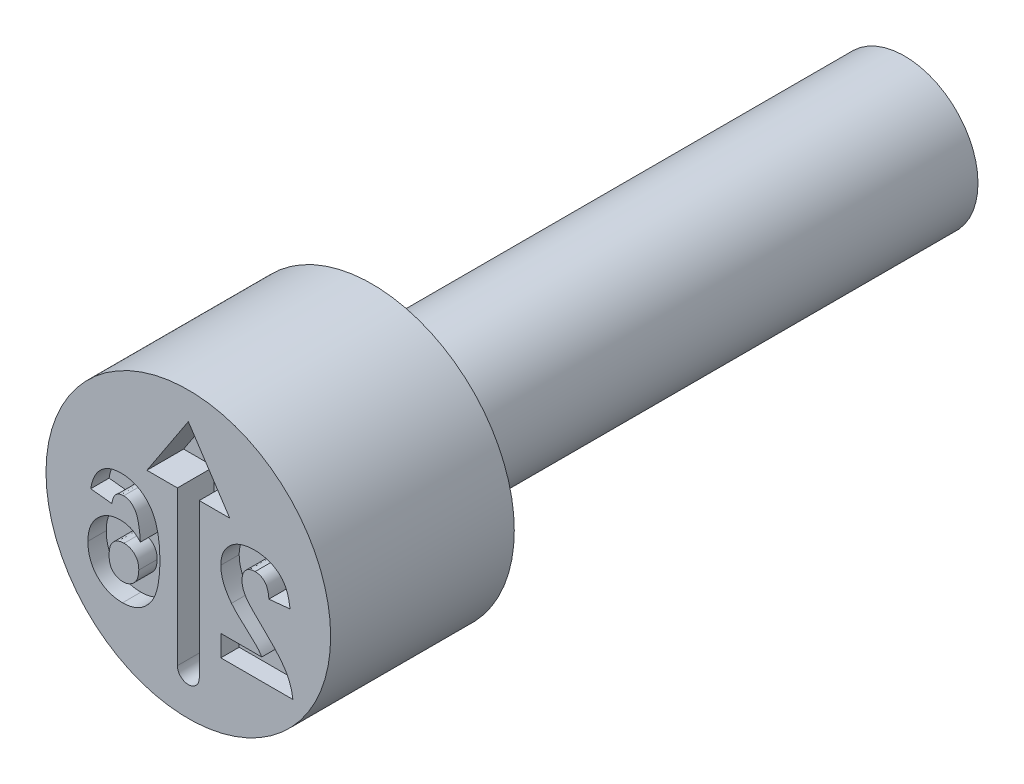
ISO-10303-21;
HEADER;
FILE_DESCRIPTION(('STEP AP214'),'2;1');
FILE_NAME('part.step','',(''),(''),'','','');
FILE_SCHEMA(('AUTOMOTIVE_DESIGN { 1 0 10303 214 1 1 1 1 }'));
ENDSEC;
DATA;
#1=APPLICATION_CONTEXT('core data for automotive mechanical design processes');
#2=APPLICATION_PROTOCOL_DEFINITION('international standard','automotive_design',2000,#1);
#3=PRODUCT_CONTEXT('',#1,'mechanical');
#4=PRODUCT('Part','Part','',(#3));
#5=PRODUCT_RELATED_PRODUCT_CATEGORY('part','',(#4));
#6=PRODUCT_DEFINITION_FORMATION('','',#4);
#7=PRODUCT_DEFINITION_CONTEXT('part definition',#1,'design');
#8=PRODUCT_DEFINITION('design','',#6,#7);
#9=PRODUCT_DEFINITION_SHAPE('','',#8);
#10=(LENGTH_UNIT() NAMED_UNIT(*) SI_UNIT(.MILLI.,.METRE.));
#11=(NAMED_UNIT(*) PLANE_ANGLE_UNIT() SI_UNIT($,.RADIAN.));
#12=(NAMED_UNIT(*) SI_UNIT($,.STERADIAN.) SOLID_ANGLE_UNIT());
#13=UNCERTAINTY_MEASURE_WITH_UNIT(LENGTH_MEASURE(1.E-05),#10,'distance_accuracy_value','');
#14=(GEOMETRIC_REPRESENTATION_CONTEXT(3) GLOBAL_UNCERTAINTY_ASSIGNED_CONTEXT((#13)) GLOBAL_UNIT_ASSIGNED_CONTEXT((#10,
#11,#12)) REPRESENTATION_CONTEXT('',''));
#15=CARTESIAN_POINT('',(0.,0.,0.));
#16=DIRECTION('',(0.,0.,1.));
#17=DIRECTION('',(1.,0.,0.));
#18=AXIS2_PLACEMENT_3D('',#15,#16,#17);
#19=CARTESIAN_POINT('',(0.,1.55,0.));
#20=DIRECTION('',(0.,0.,-1.));
#21=DIRECTION('',(-1.,0.,0.));
#22=AXIS2_PLACEMENT_3D('',#19,#20,#21);
#23=PLANE('',#22);
#24=DIRECTION('',(0.994071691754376,-0.108726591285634,0.));
#25=VECTOR('',#24,1.);
#26=CARTESIAN_POINT('',(-1.06276923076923,0.086778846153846,0.));
#27=LINE('',#26,#25);
#28=CARTESIAN_POINT('',(-1.06276923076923,0.0867788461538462,0.));
#29=VERTEX_POINT('',#28);
#30=CARTESIAN_POINT('',(-0.831999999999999,0.0615384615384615,0.));
#31=VERTEX_POINT('',#30);
#32=EDGE_CURVE('E334',#29,#31,#27,.T.);
#33=ORIENTED_EDGE('',*,*,#32,.F.);
#34=CARTESIAN_POINT('',(-0.733442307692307,0.4,0.));
#35=CARTESIAN_POINT('',(-0.744272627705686,0.399805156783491,0.));
#36=CARTESIAN_POINT('',(-0.765444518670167,0.399424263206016,0.));
#37=CARTESIAN_POINT('',(-0.796474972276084,0.39537949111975,0.));
#38=CARTESIAN_POINT('',(-0.826077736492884,0.389194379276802,0.));
#39=CARTESIAN_POINT('',(-0.854330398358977,0.380632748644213,0.));
#40=CARTESIAN_POINT('',(-0.881034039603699,0.369167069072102,0.));
#41=CARTESIAN_POINT('',(-0.906294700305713,0.355199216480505,0.));
#42=CARTESIAN_POINT('',(-0.930197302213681,0.338767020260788,0.));
#43=CARTESIAN_POINT('',(-0.952617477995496,0.319976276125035,0.));
#44=CARTESIAN_POINT('',(-0.973374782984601,0.298770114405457,0.));
#45=CARTESIAN_POINT('',(-0.992118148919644,0.275100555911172,0.));
#46=CARTESIAN_POINT('',(-1.0089717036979,0.249253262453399,0.));
#47=CARTESIAN_POINT('',(-1.02400920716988,0.221249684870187,0.));
#48=CARTESIAN_POINT('',(-1.03662241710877,0.190821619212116,0.));
#49=CARTESIAN_POINT('',(-1.04746555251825,0.158208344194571,0.));
#50=CARTESIAN_POINT('',(-1.05638327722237,0.123339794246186,0.));
#51=CARTESIAN_POINT('',(-1.06060812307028,0.0991516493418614,0.));
#52=CARTESIAN_POINT('',(-1.06276923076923,0.086778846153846,0.));
#53=B_SPLINE_CURVE_WITH_KNOTS('',3,(#34,#35,#36,#37,#38,#39,#40,#41,#42,#43,#44,#45,#46,#47,#48,
#49,#50,#51,#52),.UNSPECIFIED.,.F.,.F.,(4,1,1,1,1,1,1,1,1,1,1,1,1,1,1,1,4),(0.,
0.0647517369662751,0.126581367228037,0.186839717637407,0.245514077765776,0.302849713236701,
0.360345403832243,0.417912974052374,0.476091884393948,0.535068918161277,0.595103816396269,
0.656390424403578,0.719434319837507,0.784953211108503,0.853160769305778,0.924888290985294,1.),.UNSPECIFIED.);
#54=CARTESIAN_POINT('',(-0.733442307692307,0.4,0.));
#55=VERTEX_POINT('',#54);
#56=EDGE_CURVE('E54',#55,#29,#53,.T.);
#57=ORIENTED_EDGE('',*,*,#56,.F.);
#58=CARTESIAN_POINT('',(-0.308923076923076,-0.216105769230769,0.));
#59=CARTESIAN_POINT('',(-0.309281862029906,-0.1898130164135,0.));
#60=CARTESIAN_POINT('',(-0.309975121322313,-0.139009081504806,0.));
#61=CARTESIAN_POINT('',(-0.315553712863,-0.0656551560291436,0.));
#62=CARTESIAN_POINT('',(-0.324414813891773,0.00208407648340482,0.));
#63=CARTESIAN_POINT('',(-0.337323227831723,0.0640558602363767,0.));
#64=CARTESIAN_POINT('',(-0.353834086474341,0.120388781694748,0.));
#65=CARTESIAN_POINT('',(-0.373850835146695,0.171196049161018,0.));
#66=CARTESIAN_POINT('',(-0.397876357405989,0.216293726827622,0.));
#67=CARTESIAN_POINT('',(-0.425809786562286,0.255535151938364,0.));
#68=CARTESIAN_POINT('',(-0.456544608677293,0.289646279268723,0.));
#69=CARTESIAN_POINT('',(-0.489569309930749,0.319089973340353,0.));
#70=CARTESIAN_POINT('',(-0.524757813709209,0.344150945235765,0.));
#71=CARTESIAN_POINT('',(-0.562109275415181,0.364765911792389,0.));
#72=CARTESIAN_POINT('',(-0.601930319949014,0.380394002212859,0.));
#73=CARTESIAN_POINT('',(-0.643843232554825,0.391679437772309,0.));
#74=CARTESIAN_POINT('',(-0.68791841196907,0.398932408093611,0.));
#75=CARTESIAN_POINT('',(-0.718109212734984,0.399640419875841,0.));
#76=CARTESIAN_POINT('',(-0.733442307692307,0.4,0.));
#77=B_SPLINE_CURVE_WITH_KNOTS('',3,(#58,#59,#60,#61,#62,#63,#64,#65,#66,#67,#68,#69,#70,#71,#72,
#73,#74,#75,#76),.UNSPECIFIED.,.F.,.F.,(4,1,1,1,1,1,1,1,1,1,1,1,1,1,1,1,4),(0.,
0.0932311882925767,0.180145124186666,0.260720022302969,0.335343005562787,0.40439372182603,
0.46866345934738,0.528671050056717,0.585123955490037,0.639046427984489,0.691174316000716,
0.741714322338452,0.79194664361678,0.84207517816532,0.893016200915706,0.945665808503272,1.),.UNSPECIFIED.);
#78=CARTESIAN_POINT('',(-0.308923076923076,-0.216105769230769,0.));
#79=VERTEX_POINT('',#78);
#80=EDGE_CURVE('E385',#79,#55,#77,.T.);
#81=ORIENTED_EDGE('',*,*,#80,.F.);
#82=CARTESIAN_POINT('',(-0.716134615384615,-0.815384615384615,0.));
#83=CARTESIAN_POINT('',(-0.701607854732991,-0.814978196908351,0.));
#84=CARTESIAN_POINT('',(-0.67304565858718,-0.814179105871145,0.));
#85=CARTESIAN_POINT('',(-0.631233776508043,-0.80760299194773,0.));
#86=CARTESIAN_POINT('',(-0.59148259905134,-0.796477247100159,0.));
#87=CARTESIAN_POINT('',(-0.553797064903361,-0.780939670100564,0.));
#88=CARTESIAN_POINT('',(-0.51786394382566,-0.761395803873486,0.));
#89=CARTESIAN_POINT('',(-0.484016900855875,-0.737118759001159,0.));
#90=CARTESIAN_POINT('',(-0.452345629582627,-0.708340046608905,0.));
#91=CARTESIAN_POINT('',(-0.422431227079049,-0.675449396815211,0.));
#92=CARTESIAN_POINT('',(-0.395209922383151,-0.63745809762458,0.));
#93=CARTESIAN_POINT('',(-0.37202802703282,-0.593548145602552,0.));
#94=CARTESIAN_POINT('',(-0.352367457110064,-0.544200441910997,0.));
#95=CARTESIAN_POINT('',(-0.336360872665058,-0.489288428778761,0.));
#96=CARTESIAN_POINT('',(-0.324004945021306,-0.428816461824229,0.));
#97=CARTESIAN_POINT('',(-0.315383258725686,-0.362779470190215,0.));
#98=CARTESIAN_POINT('',(-0.309656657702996,-0.291286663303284,0.));
#99=CARTESIAN_POINT('',(-0.309173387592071,-0.241758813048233,0.));
#100=CARTESIAN_POINT('',(-0.308923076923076,-0.216105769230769,0.));
#101=B_SPLINE_CURVE_WITH_KNOTS('',3,(#82,#83,#84,#85,#86,#87,#88,#89,#90,#91,#92,#93,#94,#95,
#96,#97,#98,#99,#100),.UNSPECIFIED.,.F.,.F.,(4,1,1,1,1,1,1,1,1,1,1,1,1,1,1,1,4),(0.,
0.0532594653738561,0.104717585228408,0.154775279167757,0.20433007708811,0.25391362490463,
0.304476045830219,0.356706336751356,0.410596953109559,0.467274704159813,0.52762561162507,
0.59224090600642,0.661798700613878,0.737130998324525,0.818387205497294,0.905933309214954,1.),.UNSPECIFIED.);
#102=CARTESIAN_POINT('',(-0.716134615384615,-0.815384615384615,0.));
#103=VERTEX_POINT('',#102);
#104=EDGE_CURVE('E377',#103,#79,#101,.T.);
#105=ORIENTED_EDGE('',*,*,#104,.F.);
#106=CARTESIAN_POINT('',(-1.09353846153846,-0.424038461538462,0.));
#107=CARTESIAN_POINT('',(-1.09320536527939,-0.438473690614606,0.));
#108=CARTESIAN_POINT('',(-1.09255574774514,-0.46662584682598,0.));
#109=CARTESIAN_POINT('',(-1.0877741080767,-0.507855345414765,0.));
#110=CARTESIAN_POINT('',(-1.07932770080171,-0.546771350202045,0.));
#111=CARTESIAN_POINT('',(-1.06778808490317,-0.58368608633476,0.));
#112=CARTESIAN_POINT('',(-1.05286192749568,-0.618307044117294,0.));
#113=CARTESIAN_POINT('',(-1.03478009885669,-0.650919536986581,0.));
#114=CARTESIAN_POINT('',(-1.01293069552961,-0.680966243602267,0.));
#115=CARTESIAN_POINT('',(-0.988305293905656,-0.70885133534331,0.));
#116=CARTESIAN_POINT('',(-0.960852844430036,-0.733735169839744,0.));
#117=CARTESIAN_POINT('',(-0.931596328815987,-0.755770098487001,0.));
#118=CARTESIAN_POINT('',(-0.90021125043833,-0.774087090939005,0.));
#119=CARTESIAN_POINT('',(-0.867161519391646,-0.789503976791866,0.));
#120=CARTESIAN_POINT('',(-0.83187948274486,-0.800817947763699,0.));
#121=CARTESIAN_POINT('',(-0.794987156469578,-0.809302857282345,0.));
#122=CARTESIAN_POINT('',(-0.756184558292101,-0.814477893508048,0.));
#123=CARTESIAN_POINT('',(-0.729692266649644,-0.815077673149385,0.));
#124=CARTESIAN_POINT('',(-0.716134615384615,-0.815384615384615,0.));
#125=B_SPLINE_CURVE_WITH_KNOTS('',3,(#106,#107,#108,#109,#110,#111,#112,#113,#114,#115,#116,
#117,#118,#119,#120,#121,#122,#123,#124),.UNSPECIFIED.,.F.,.F.,(4,1,1,1,1,1,1,1,1,1,1,1,1,1,1,1,
4),(0.,0.0708046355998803,0.13808600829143,0.203231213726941,0.265884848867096,
0.327509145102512,0.387868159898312,0.448411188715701,0.509386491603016,0.570040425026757,
0.629864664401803,0.688715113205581,0.747985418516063,0.808394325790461,0.870086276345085,
0.933515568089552,1.),.UNSPECIFIED.);
#126=CARTESIAN_POINT('',(-1.09353846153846,-0.424038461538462,0.));
#127=VERTEX_POINT('',#126);
#128=EDGE_CURVE('E369',#127,#103,#125,.T.);
#129=ORIENTED_EDGE('',*,*,#128,.F.);
#130=CARTESIAN_POINT('',(-0.738971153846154,-0.0461538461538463,0.));
#131=CARTESIAN_POINT('',(-0.750924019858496,-0.0464980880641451,0.));
#132=CARTESIAN_POINT('',(-0.774526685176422,-0.0471778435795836,0.));
#133=CARTESIAN_POINT('',(-0.809298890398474,-0.0519455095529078,0.));
#134=CARTESIAN_POINT('',(-0.842665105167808,-0.0605186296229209,0.));
#135=CARTESIAN_POINT('',(-0.87477627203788,-0.0721158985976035,0.));
#136=CARTESIAN_POINT('',(-0.905791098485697,-0.0867197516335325,0.));
#137=CARTESIAN_POINT('',(-0.935116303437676,-0.105206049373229,0.));
#138=CARTESIAN_POINT('',(-0.963212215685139,-0.126760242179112,0.));
#139=CARTESIAN_POINT('',(-0.989692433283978,-0.151385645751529,0.));
#140=CARTESIAN_POINT('',(-1.0140213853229,-0.178496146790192,0.));
#141=CARTESIAN_POINT('',(-1.03550144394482,-0.20777763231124,0.));
#142=CARTESIAN_POINT('',(-1.05317882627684,-0.239319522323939,0.));
#143=CARTESIAN_POINT('',(-1.06829087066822,-0.272415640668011,0.));
#144=CARTESIAN_POINT('',(-1.07953480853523,-0.307719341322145,0.));
#145=CARTESIAN_POINT('',(-1.08769671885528,-0.344722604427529,0.));
#146=CARTESIAN_POINT('',(-1.09256880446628,-0.383765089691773,0.));
#147=CARTESIAN_POINT('',(-1.09321015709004,-0.410402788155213,0.));
#148=CARTESIAN_POINT('',(-1.09353846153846,-0.424038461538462,0.));
#149=B_SPLINE_CURVE_WITH_KNOTS('',3,(#130,#131,#132,#133,#134,#135,#136,#137,#138,#139,#140,
#141,#142,#143,#144,#145,#146,#147,#148),.UNSPECIFIED.,.F.,.F.,(4,1,1,1,1,1,1,1,1,1,1,1,1,1,1,1,
4),(0.,0.0619593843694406,0.122347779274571,0.181484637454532,0.240217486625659,
0.299114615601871,0.358819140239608,0.419550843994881,0.482449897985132,0.545990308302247,
0.608137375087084,0.670271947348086,0.733113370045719,0.796428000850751,0.8619364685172,
0.9293261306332,1.),.UNSPECIFIED.);
#150=CARTESIAN_POINT('',(-0.738971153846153,-0.0461538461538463,0.));
#151=VERTEX_POINT('',#150);
#152=EDGE_CURVE('E361',#151,#127,#149,.T.);
#153=ORIENTED_EDGE('',*,*,#152,.F.);
#154=CARTESIAN_POINT('',(-0.522144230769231,-0.146634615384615,0.));
#155=CARTESIAN_POINT('',(-0.52951964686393,-0.138623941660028,0.));
#156=CARTESIAN_POINT('',(-0.543982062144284,-0.12291585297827,0.));
#157=CARTESIAN_POINT('',(-0.56797977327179,-0.102436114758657,0.));
#158=CARTESIAN_POINT('',(-0.593120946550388,-0.0849273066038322,0.));
#159=CARTESIAN_POINT('',(-0.61967915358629,-0.0705628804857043,0.));
#160=CARTESIAN_POINT('',(-0.647799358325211,-0.0598732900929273,0.));
#161=CARTESIAN_POINT('',(-0.676972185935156,-0.0517568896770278,0.));
#162=CARTESIAN_POINT('',(-0.707579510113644,-0.0472104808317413,0.));
#163=CARTESIAN_POINT('',(-0.728380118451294,-0.0465103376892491,0.));
#164=CARTESIAN_POINT('',(-0.738971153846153,-0.0461538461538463,0.));
#165=B_SPLINE_CURVE_WITH_KNOTS('',3,(#154,#155,#156,#157,#158,#159,#160,#161,#162,#163,#164),
.UNSPECIFIED.,.F.,.F.,(4,1,1,1,1,1,1,1,4),(0.,0.132218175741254,0.259265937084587,
0.382426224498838,0.503963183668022,0.625109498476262,0.747226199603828,0.871295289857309,1.),.UNSPECIFIED.);
#166=CARTESIAN_POINT('',(-0.522144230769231,-0.146634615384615,0.));
#167=VERTEX_POINT('',#166);
#168=EDGE_CURVE('E353',#167,#151,#165,.T.);
#169=ORIENTED_EDGE('',*,*,#168,.F.);
#170=CARTESIAN_POINT('',(-0.703875,0.2,0.));
#171=CARTESIAN_POINT('',(-0.698087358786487,0.199858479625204,0.));
#172=CARTESIAN_POINT('',(-0.686570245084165,0.199576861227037,0.));
#173=CARTESIAN_POINT('',(-0.669794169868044,0.196001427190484,0.));
#174=CARTESIAN_POINT('',(-0.65362001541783,0.190695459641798,0.));
#175=CARTESIAN_POINT('',(-0.6381797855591,0.183180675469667,0.));
#176=CARTESIAN_POINT('',(-0.623396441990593,0.173484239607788,0.));
#177=CARTESIAN_POINT('',(-0.609494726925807,0.161490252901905,0.));
#178=CARTESIAN_POINT('',(-0.595835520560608,0.147830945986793,0.));
#179=CARTESIAN_POINT('',(-0.583222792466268,0.131336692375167,0.));
#180=CARTESIAN_POINT('',(-0.571122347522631,0.111806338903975,0.));
#181=CARTESIAN_POINT('',(-0.560703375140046,0.0878975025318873,0.));
#182=CARTESIAN_POINT('',(-0.551416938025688,0.0596323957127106,0.));
#183=CARTESIAN_POINT('',(-0.543465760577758,0.0268725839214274,0.));
#184=CARTESIAN_POINT('',(-0.536250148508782,-0.0101739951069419,0.));
#185=CARTESIAN_POINT('',(-0.530335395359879,-0.0516573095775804,0.));
#186=CARTESIAN_POINT('',(-0.525602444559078,-0.0976146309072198,0.));
#187=CARTESIAN_POINT('',(-0.523331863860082,-0.129799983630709,0.));
#188=CARTESIAN_POINT('',(-0.522144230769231,-0.146634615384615,0.));
#189=B_SPLINE_CURVE_WITH_KNOTS('',3,(#170,#171,#172,#173,#174,#175,#176,#177,#178,#179,#180,
#181,#182,#183,#184,#185,#186,#187,#188),.UNSPECIFIED.,.F.,.F.,(4,1,1,1,1,1,1,1,1,1,1,1,1,1,1,1,
4),(0.,0.0401536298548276,0.0799036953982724,0.11864246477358,0.158240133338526,
0.198858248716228,0.241137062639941,0.285631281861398,0.332856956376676,0.385095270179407,
0.444912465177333,0.513585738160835,0.591645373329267,0.679009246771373,0.775790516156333,
0.882726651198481,1.),.UNSPECIFIED.);
#190=CARTESIAN_POINT('',(-0.703875,0.2,0.));
#191=VERTEX_POINT('',#190);
#192=EDGE_CURVE('E345',#191,#167,#189,.T.);
#193=ORIENTED_EDGE('',*,*,#192,.F.);
#194=CARTESIAN_POINT('',(-0.831999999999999,0.0615384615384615,0.));
#195=CARTESIAN_POINT('',(-0.830453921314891,0.0726533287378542,0.));
#196=CARTESIAN_POINT('',(-0.827544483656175,0.0935694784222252,0.));
#197=CARTESIAN_POINT('',(-0.818926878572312,0.122433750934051,0.));
#198=CARTESIAN_POINT('',(-0.806930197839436,0.146715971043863,0.));
#199=CARTESIAN_POINT('',(-0.791531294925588,0.16645009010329,0.));
#200=CARTESIAN_POINT('',(-0.773189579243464,0.181638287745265,0.));
#201=CARTESIAN_POINT('',(-0.75229018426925,0.192430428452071,0.));
#202=CARTESIAN_POINT('',(-0.728846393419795,0.198836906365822,0.));
#203=CARTESIAN_POINT('',(-0.712409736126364,0.199602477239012,0.));
#204=CARTESIAN_POINT('',(-0.703875,0.2,0.));
#205=B_SPLINE_CURVE_WITH_KNOTS('',3,(#194,#195,#196,#197,#198,#199,#200,#201,#202,#203,#204),
.UNSPECIFIED.,.F.,.F.,(4,1,1,1,1,1,1,1,4),(0.,0.160089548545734,0.301259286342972,
0.428171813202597,0.544692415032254,0.656041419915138,0.765564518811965,0.878269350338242,1.),.UNSPECIFIED.);
#206=EDGE_CURVE('E340',#31,#191,#205,.T.);
#207=ORIENTED_EDGE('',*,*,#206,.F.);
#208=EDGE_LOOP('',(#33,#57,#81,#105,#129,#153,#169,#193,#207));
#209=FACE_BOUND('',#208,.T.);
#210=CARTESIAN_POINT('',(0.,0.,0.));
#211=DIRECTION('',(0.,0.,1.));
#212=DIRECTION('',(1.,0.,0.));
#213=AXIS2_PLACEMENT_3D('',#210,#211,#212);
#214=CIRCLE('',#213,1.55);
#215=CARTESIAN_POINT('',(1.55,0.,0.));
#216=VERTEX_POINT('',#215);
#217=EDGE_CURVE('E47',#216,#216,#214,.T.);
#218=ORIENTED_EDGE('',*,*,#217,.T.);
#219=EDGE_LOOP('',(#218));
#220=FACE_BOUND('',#219,.T.);
#221=DIRECTION('',(0.,1.,0.));
#222=VECTOR('',#221,1.);
#223=CARTESIAN_POINT('',(0.119045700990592,0.566469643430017,0.));
#224=LINE('',#223,#222);
#225=CARTESIAN_POINT('',(0.119045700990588,-1.11010114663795,0.));
#226=VERTEX_POINT('',#225);
#227=CARTESIAN_POINT('',(0.119045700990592,0.566469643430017,0.));
#228=VERTEX_POINT('',#227);
#229=EDGE_CURVE('E527',#226,#228,#224,.T.);
#230=ORIENTED_EDGE('',*,*,#229,.F.);
#231=CARTESIAN_POINT('',(1.02140308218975E-13,-1.11010114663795,0.));
#232=DIRECTION('',(0.,0.,1.));
#233=DIRECTION('',(1.,0.,0.));
#234=AXIS2_PLACEMENT_3D('',#231,#232,#233);
#235=CIRCLE('',#234,0.119045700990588);
#236=CARTESIAN_POINT('',(-0.119045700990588,-1.11010114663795,0.));
#237=VERTEX_POINT('',#236);
#238=EDGE_CURVE('E619',#237,#226,#235,.T.);
#239=ORIENTED_EDGE('',*,*,#238,.F.);
#240=DIRECTION('',(0.,-1.,0.));
#241=VECTOR('',#240,1.);
#242=CARTESIAN_POINT('',(-0.119045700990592,0.566469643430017,0.));
#243=LINE('',#242,#241);
#244=CARTESIAN_POINT('',(-0.119045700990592,0.566469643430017,0.));
#245=VERTEX_POINT('',#244);
#246=EDGE_CURVE('E649',#245,#237,#243,.T.);
#247=ORIENTED_EDGE('',*,*,#246,.F.);
#248=DIRECTION('',(1.,0.,0.));
#249=VECTOR('',#248,1.);
#250=CARTESIAN_POINT('',(-0.451198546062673,0.566469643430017,0.));
#251=LINE('',#250,#249);
#252=CARTESIAN_POINT('',(-0.451198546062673,0.566469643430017,0.));
#253=VERTEX_POINT('',#252);
#254=EDGE_CURVE('E679',#253,#245,#251,.T.);
#255=ORIENTED_EDGE('',*,*,#254,.F.);
#256=DIRECTION('',(-0.550159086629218,-0.835059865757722,0.));
#257=VECTOR('',#256,1.);
#258=CARTESIAN_POINT('',(0.,1.25132209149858,0.));
#259=LINE('',#258,#257);
#260=CARTESIAN_POINT('',(0.,1.25132209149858,0.));
#261=VERTEX_POINT('',#260);
#262=EDGE_CURVE('E676',#261,#253,#259,.T.);
#263=ORIENTED_EDGE('',*,*,#262,.F.);
#264=DIRECTION('',(-0.550159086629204,0.835059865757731,0.));
#265=VECTOR('',#264,1.);
#266=CARTESIAN_POINT('',(0.,1.25132209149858,0.));
#267=LINE('',#266,#265);
#268=CARTESIAN_POINT('',(0.451198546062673,0.566469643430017,0.));
#269=VERTEX_POINT('',#268);
#270=EDGE_CURVE('E673',#269,#261,#267,.T.);
#271=ORIENTED_EDGE('',*,*,#270,.F.);
#272=DIRECTION('',(1.,0.,0.));
#273=VECTOR('',#272,1.);
#274=CARTESIAN_POINT('',(0.451198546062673,0.566469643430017,0.));
#275=LINE('',#274,#273);
#276=EDGE_CURVE('E670',#228,#269,#275,.T.);
#277=ORIENTED_EDGE('',*,*,#276,.F.);
#278=EDGE_LOOP('',(#230,#239,#247,#255,#263,#271,#277));
#279=FACE_BOUND('',#278,.T.);
#280=DIRECTION('',(0.,-1.,0.));
#281=VECTOR('',#280,1.);
#282=CARTESIAN_POINT('',(0.353846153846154,-0.569230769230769,0.));
#283=LINE('',#282,#281);
#284=CARTESIAN_POINT('',(0.353846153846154,-0.569230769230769,0.));
#285=VERTEX_POINT('',#284);
#286=CARTESIAN_POINT('',(0.353846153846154,-0.8,0.));
#287=VERTEX_POINT('',#286);
#288=EDGE_CURVE('E532',#285,#287,#283,.T.);
#289=ORIENTED_EDGE('',*,*,#288,.F.);
#290=DIRECTION('',(-1.,0.,0.));
#291=VECTOR('',#290,1.);
#292=CARTESIAN_POINT('',(0.799759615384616,-0.569230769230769,0.));
#293=LINE('',#292,#291);
#294=CARTESIAN_POINT('',(0.799759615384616,-0.569230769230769,0.));
#295=VERTEX_POINT('',#294);
#296=EDGE_CURVE('E399',#295,#285,#293,.T.);
#297=ORIENTED_EDGE('',*,*,#296,.F.);
#298=CARTESIAN_POINT('',(0.470192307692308,-0.227403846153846,0.));
#299=CARTESIAN_POINT('',(0.473842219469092,-0.232000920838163,0.));
#300=CARTESIAN_POINT('',(0.48165948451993,-0.241846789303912,0.));
#301=CARTESIAN_POINT('',(0.494958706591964,-0.256943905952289,0.));
#302=CARTESIAN_POINT('',(0.510371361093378,-0.273434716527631,0.));
#303=CARTESIAN_POINT('',(0.527679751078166,-0.291627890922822,0.));
#304=CARTESIAN_POINT('',(0.547455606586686,-0.310879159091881,0.));
#305=CARTESIAN_POINT('',(0.568987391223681,-0.331993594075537,0.));
#306=CARTESIAN_POINT('',(0.593222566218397,-0.35389112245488,0.));
#307=CARTESIAN_POINT('',(0.618324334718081,-0.377117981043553,0.));
#308=CARTESIAN_POINT('',(0.64353521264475,-0.399724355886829,0.));
#309=CARTESIAN_POINT('',(0.666707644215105,-0.421195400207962,0.));
#310=CARTESIAN_POINT('',(0.687755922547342,-0.44019266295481,0.));
#311=CARTESIAN_POINT('',(0.705699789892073,-0.457764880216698,0.));
#312=CARTESIAN_POINT('',(0.721594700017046,-0.472712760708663,0.));
#313=CARTESIAN_POINT('',(0.734867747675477,-0.485802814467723,0.));
#314=CARTESIAN_POINT('',(0.745767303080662,-0.496718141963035,0.));
#315=CARTESIAN_POINT('',(0.760786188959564,-0.513732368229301,0.));
#316=CARTESIAN_POINT('',(0.779896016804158,-0.536744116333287,0.));
#317=CARTESIAN_POINT('',(0.793340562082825,-0.558732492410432,0.));
#318=CARTESIAN_POINT('',(0.799759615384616,-0.569230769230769,0.));
#319=B_SPLINE_CURVE_WITH_KNOTS('',3,(#298,#299,#300,#301,#302,#303,#304,#305,#306,#307,#308,
#309,#310,#311,#312,#313,#314,#315,#316,#317,#318),.UNSPECIFIED.,.F.,.F.,(4,1,1,1,1,1,1,1,1,1,1,
1,1,1,1,1,1,1,4),(0.,0.0369753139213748,0.0791925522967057,0.126700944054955,0.179184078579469,
0.237368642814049,0.300558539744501,0.369153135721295,0.443112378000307,0.516018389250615,
0.582473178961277,0.642136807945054,0.694619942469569,0.740679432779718,0.779589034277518,
0.812073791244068,0.837814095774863,0.922564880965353,1.),.UNSPECIFIED.);
#320=CARTESIAN_POINT('',(0.470192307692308,-0.227403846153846,0.));
#321=VERTEX_POINT('',#320);
#322=EDGE_CURVE('E419',#321,#295,#319,.T.);
#323=ORIENTED_EDGE('',*,*,#322,.F.);
#324=CARTESIAN_POINT('',(0.353846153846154,0.0735576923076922,0.));
#325=CARTESIAN_POINT('',(0.354139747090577,0.0604771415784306,0.));
#326=CARTESIAN_POINT('',(0.354722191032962,0.0345273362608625,0.));
#327=CARTESIAN_POINT('',(0.360298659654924,-0.00383422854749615,0.));
#328=CARTESIAN_POINT('',(0.368818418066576,-0.0413111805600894,0.));
#329=CARTESIAN_POINT('',(0.381409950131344,-0.0779951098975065,0.));
#330=CARTESIAN_POINT('',(0.397370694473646,-0.114765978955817,0.));
#331=CARTESIAN_POINT('',(0.417944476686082,-0.151706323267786,0.));
#332=CARTESIAN_POINT('',(0.441832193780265,-0.189930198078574,0.));
#333=CARTESIAN_POINT('',(0.46053533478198,-0.21464360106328,0.));
#334=CARTESIAN_POINT('',(0.470192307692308,-0.227403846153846,0.));
#335=B_SPLINE_CURVE_WITH_KNOTS('',3,(#324,#325,#326,#327,#328,#329,#330,#331,#332,#333,#334),
.UNSPECIFIED.,.F.,.F.,(4,1,1,1,1,1,1,1,4),(0.,0.119176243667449,0.236427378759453,
0.352663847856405,0.469086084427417,0.589462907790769,0.717601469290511,0.854189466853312,1.),.UNSPECIFIED.);
#336=CARTESIAN_POINT('',(0.353846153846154,0.0735576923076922,0.));
#337=VERTEX_POINT('',#336);
#338=EDGE_CURVE('E599',#337,#321,#335,.T.);
#339=ORIENTED_EDGE('',*,*,#338,.F.);
#340=CARTESIAN_POINT('',(0.722115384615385,0.4,0.));
#341=CARTESIAN_POINT('',(0.708162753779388,0.399731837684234,0.));
#342=CARTESIAN_POINT('',(0.680988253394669,0.399209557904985,0.));
#343=CARTESIAN_POINT('',(0.641318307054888,0.394896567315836,0.));
#344=CARTESIAN_POINT('',(0.604051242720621,0.387376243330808,0.));
#345=CARTESIAN_POINT('',(0.568861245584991,0.377414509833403,0.));
#346=CARTESIAN_POINT('',(0.536109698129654,0.364114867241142,0.));
#347=CARTESIAN_POINT('',(0.505523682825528,0.348036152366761,0.));
#348=CARTESIAN_POINT('',(0.477584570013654,0.32856814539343,0.));
#349=CARTESIAN_POINT('',(0.451875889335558,0.306772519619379,0.));
#350=CARTESIAN_POINT('',(0.428894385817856,0.282804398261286,0.));
#351=CARTESIAN_POINT('',(0.408764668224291,0.257238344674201,0.));
#352=CARTESIAN_POINT('',(0.391900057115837,0.230092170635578,0.));
#353=CARTESIAN_POINT('',(0.37774805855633,0.201696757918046,0.));
#354=CARTESIAN_POINT('',(0.367240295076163,0.171595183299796,0.));
#355=CARTESIAN_POINT('',(0.35958388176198,0.140203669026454,0.));
#356=CARTESIAN_POINT('',(0.354507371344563,0.10737576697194,0.));
#357=CARTESIAN_POINT('',(0.354068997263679,0.0849550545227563,0.));
#358=CARTESIAN_POINT('',(0.353846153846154,0.0735576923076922,0.));
#359=B_SPLINE_CURVE_WITH_KNOTS('',3,(#340,#341,#342,#343,#344,#345,#346,#347,#348,#349,#350,
#351,#352,#353,#354,#355,#356,#357,#358),.UNSPECIFIED.,.F.,.F.,(4,1,1,1,1,1,1,1,1,1,1,1,1,1,1,1,
4),(0.,0.0756723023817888,0.147381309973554,0.216084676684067,0.28169803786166,
0.345459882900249,0.407485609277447,0.46873129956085,0.529782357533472,0.590032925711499,
0.648548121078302,0.70595351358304,0.763101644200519,0.820289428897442,0.878479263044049,
0.938226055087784,1.),.UNSPECIFIED.);
#360=CARTESIAN_POINT('',(0.722115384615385,0.4,0.));
#361=VERTEX_POINT('',#360);
#362=EDGE_CURVE('E591',#361,#337,#359,.T.);
#363=ORIENTED_EDGE('',*,*,#362,.F.);
#364=CARTESIAN_POINT('',(1.10769230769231,0.0379807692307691,0.));
#365=CARTESIAN_POINT('',(1.10583695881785,0.0535606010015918,0.));
#366=CARTESIAN_POINT('',(1.10223973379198,0.0837674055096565,0.));
#367=CARTESIAN_POINT('',(1.09326279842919,0.127154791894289,0.));
#368=CARTESIAN_POINT('',(1.08189384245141,0.167181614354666,0.));
#369=CARTESIAN_POINT('',(1.06759086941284,0.203773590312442,0.));
#370=CARTESIAN_POINT('',(1.05094503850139,0.23716340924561,0.));
#371=CARTESIAN_POINT('',(1.03110727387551,0.266850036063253,0.));
#372=CARTESIAN_POINT('',(1.00877072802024,0.293162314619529,0.));
#373=CARTESIAN_POINT('',(0.983916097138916,0.316086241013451,0.));
#374=CARTESIAN_POINT('',(0.956701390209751,0.335694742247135,0.));
#375=CARTESIAN_POINT('',(0.928144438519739,0.353198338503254,0.));
#376=CARTESIAN_POINT('',(0.897687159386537,0.36755685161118,0.));
#377=CARTESIAN_POINT('',(0.865664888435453,0.379390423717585,0.));
#378=CARTESIAN_POINT('',(0.832092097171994,0.388847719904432,0.));
#379=CARTESIAN_POINT('',(0.796813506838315,0.395100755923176,0.));
#380=CARTESIAN_POINT('',(0.760046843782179,0.399499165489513,0.));
#381=CARTESIAN_POINT('',(0.734949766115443,0.399830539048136,0.));
#382=CARTESIAN_POINT('',(0.722115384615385,0.4,0.));
#383=B_SPLINE_CURVE_WITH_KNOTS('',3,(#364,#365,#366,#367,#368,#369,#370,#371,#372,#373,#374,
#375,#376,#377,#378,#379,#380,#381,#382),.UNSPECIFIED.,.F.,.F.,(4,1,1,1,1,1,1,1,1,1,1,1,1,1,1,1,
4),(0.,0.0794357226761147,0.154013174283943,0.224141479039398,0.289934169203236,
0.352732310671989,0.412725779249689,0.470302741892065,0.527168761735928,0.583502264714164,
0.639948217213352,0.696584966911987,0.753726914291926,0.812707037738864,0.872963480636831,
0.93503486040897,1.),.UNSPECIFIED.);
#384=CARTESIAN_POINT('',(1.10769230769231,0.0379807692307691,0.));
#385=VERTEX_POINT('',#384);
#386=EDGE_CURVE('E586',#385,#361,#383,.T.);
#387=ORIENTED_EDGE('',*,*,#386,.F.);
#388=DIRECTION('',(0.995240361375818,0.0974506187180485,0.));
#389=VECTOR('',#388,1.);
#390=CARTESIAN_POINT('',(0.876923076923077,0.0153846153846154,0.));
#391=LINE('',#390,#389);
#392=CARTESIAN_POINT('',(0.876923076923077,0.0153846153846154,0.));
#393=VERTEX_POINT('',#392);
#394=EDGE_CURVE('E580',#393,#385,#391,.T.);
#395=ORIENTED_EDGE('',*,*,#394,.F.);
#396=CARTESIAN_POINT('',(0.726923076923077,0.2,0.));
#397=CARTESIAN_POINT('',(0.737389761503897,0.199525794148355,0.));
#398=CARTESIAN_POINT('',(0.757609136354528,0.198609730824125,0.));
#399=CARTESIAN_POINT('',(0.786345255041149,0.190607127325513,0.));
#400=CARTESIAN_POINT('',(0.811484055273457,0.176753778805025,0.));
#401=CARTESIAN_POINT('',(0.829399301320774,0.160966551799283,0.));
#402=CARTESIAN_POINT('',(0.841501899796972,0.145614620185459,0.));
#403=CARTESIAN_POINT('',(0.849748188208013,0.132236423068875,0.));
#404=CARTESIAN_POINT('',(0.856855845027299,0.117034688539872,0.));
#405=CARTESIAN_POINT('',(0.863153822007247,0.100180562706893,0.));
#406=CARTESIAN_POINT('',(0.868128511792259,0.0814809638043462,0.));
#407=CARTESIAN_POINT('',(0.872134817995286,0.0610783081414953,0.));
#408=CARTESIAN_POINT('',(0.875363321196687,0.038862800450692,0.));
#409=CARTESIAN_POINT('',(0.876390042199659,0.023408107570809,0.));
#410=CARTESIAN_POINT('',(0.876923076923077,0.0153846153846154,0.));
#411=B_SPLINE_CURVE_WITH_KNOTS('',3,(#396,#397,#398,#399,#400,#401,#402,#403,#404,#405,#406,
#407,#408,#409,#410),.UNSPECIFIED.,.F.,.F.,(4,1,1,1,1,1,1,1,1,1,1,1,4),(0.,0.116899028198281,
0.225823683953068,0.330086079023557,0.435451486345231,0.490306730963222,0.54824405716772,
0.610766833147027,0.677675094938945,0.749188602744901,0.826858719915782,0.910111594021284,1.),.UNSPECIFIED.);
#412=CARTESIAN_POINT('',(0.726923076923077,0.2,0.));
#413=VERTEX_POINT('',#412);
#414=EDGE_CURVE('E572',#413,#393,#411,.T.);
#415=ORIENTED_EDGE('',*,*,#414,.F.);
#416=CARTESIAN_POINT('',(0.584615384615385,0.0425480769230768,0.));
#417=CARTESIAN_POINT('',(0.585047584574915,0.0545209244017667,0.));
#418=CARTESIAN_POINT('',(0.585865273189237,0.0771726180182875,0.));
#419=CARTESIAN_POINT('',(0.592721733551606,0.109138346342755,0.));
#420=CARTESIAN_POINT('',(0.604880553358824,0.136617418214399,0.));
#421=CARTESIAN_POINT('',(0.621621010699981,0.159694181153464,0.));
#422=CARTESIAN_POINT('',(0.64278935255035,0.177774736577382,0.));
#423=CARTESIAN_POINT('',(0.667535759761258,0.1911345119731,0.));
#424=CARTESIAN_POINT('',(0.696222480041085,0.198520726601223,0.));
#425=CARTESIAN_POINT('',(0.716385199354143,0.1994922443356,0.));
#426=CARTESIAN_POINT('',(0.726923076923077,0.2,0.));
#427=B_SPLINE_CURVE_WITH_KNOTS('',3,(#416,#417,#418,#419,#420,#421,#422,#423,#424,#425,#426),
.UNSPECIFIED.,.F.,.F.,(4,1,1,1,1,1,1,1,4),(0.,0.149140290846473,0.282161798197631,
0.404655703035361,0.521109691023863,0.634416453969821,0.748796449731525,0.868710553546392,1.),.UNSPECIFIED.);
#428=CARTESIAN_POINT('',(0.584615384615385,0.0425480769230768,0.));
#429=VERTEX_POINT('',#428);
#430=EDGE_CURVE('E564',#429,#413,#427,.T.);
#431=ORIENTED_EDGE('',*,*,#430,.F.);
#432=CARTESIAN_POINT('',(0.630288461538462,-0.0961538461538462,0.));
#433=CARTESIAN_POINT('',(0.623340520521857,-0.0846125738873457,0.));
#434=CARTESIAN_POINT('',(0.609938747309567,-0.0623507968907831,0.));
#435=CARTESIAN_POINT('',(0.59524259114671,-0.027343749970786,0.));
#436=CARTESIAN_POINT('',(0.586421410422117,0.00765606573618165,0.));
#437=CARTESIAN_POINT('',(0.585210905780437,0.0310427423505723,0.));
#438=CARTESIAN_POINT('',(0.584615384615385,0.0425480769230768,0.));
#439=B_SPLINE_CURVE_WITH_KNOTS('',3,(#432,#433,#434,#435,#436,#437,#438),.UNSPECIFIED.,.F.,.F.,
(4,1,1,1,4),(0.,0.272795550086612,0.526191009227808,0.766904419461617,1.),.UNSPECIFIED.);
#440=CARTESIAN_POINT('',(0.630288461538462,-0.0961538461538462,0.));
#441=VERTEX_POINT('',#440);
#442=EDGE_CURVE('E556',#441,#429,#439,.T.);
#443=ORIENTED_EDGE('',*,*,#442,.F.);
#444=CARTESIAN_POINT('',(0.813942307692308,-0.289903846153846,0.));
#445=CARTESIAN_POINT('',(0.802077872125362,-0.278451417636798,0.));
#446=CARTESIAN_POINT('',(0.779491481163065,-0.256649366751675,0.));
#447=CARTESIAN_POINT('',(0.747328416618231,-0.225429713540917,0.));
#448=CARTESIAN_POINT('',(0.719053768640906,-0.196729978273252,0.));
#449=CARTESIAN_POINT('',(0.694076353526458,-0.171293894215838,0.));
#450=CARTESIAN_POINT('',(0.672973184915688,-0.148473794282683,0.));
#451=CARTESIAN_POINT('',(0.655466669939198,-0.128628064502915,0.));
#452=CARTESIAN_POINT('',(0.641335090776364,-0.111675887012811,0.));
#453=CARTESIAN_POINT('',(0.633681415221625,-0.100921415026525,0.));
#454=CARTESIAN_POINT('',(0.630288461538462,-0.0961538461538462,0.));
#455=B_SPLINE_CURVE_WITH_KNOTS('',3,(#444,#445,#446,#447,#448,#449,#450,#451,#452,#453,#454),
.UNSPECIFIED.,.F.,.F.,(4,1,1,1,1,1,1,1,4),(0.,0.18509006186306,0.352356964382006,
0.503079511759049,0.637279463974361,0.752473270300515,0.851885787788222,0.934339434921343,1.),.UNSPECIFIED.);
#456=CARTESIAN_POINT('',(0.813942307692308,-0.289903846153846,0.));
#457=VERTEX_POINT('',#456);
#458=EDGE_CURVE('E548',#457,#441,#455,.T.);
#459=ORIENTED_EDGE('',*,*,#458,.F.);
#460=CARTESIAN_POINT('',(1.13846153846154,-0.8,0.));
#461=CARTESIAN_POINT('',(1.1358050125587,-0.780277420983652,0.));
#462=CARTESIAN_POINT('',(1.13049345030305,-0.740843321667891,0.));
#463=CARTESIAN_POINT('',(1.11407199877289,-0.683240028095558,0.));
#464=CARTESIAN_POINT('',(1.09215498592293,-0.627029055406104,0.));
#465=CARTESIAN_POINT('',(1.06836823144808,-0.58128696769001,0.));
#466=CARTESIAN_POINT('',(1.04470966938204,-0.544466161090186,0.));
#467=CARTESIAN_POINT('',(1.02324425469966,-0.514294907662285,0.));
#468=CARTESIAN_POINT('',(0.997636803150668,-0.482193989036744,0.));
#469=CARTESIAN_POINT('',(0.968258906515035,-0.447904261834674,0.));
#470=CARTESIAN_POINT('',(0.93527291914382,-0.411318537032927,0.));
#471=CARTESIAN_POINT('',(0.898432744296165,-0.37257283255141,0.));
#472=CARTESIAN_POINT('',(0.85756264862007,-0.331852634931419,0.));
#473=CARTESIAN_POINT('',(0.828809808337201,-0.304201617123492,0.));
#474=CARTESIAN_POINT('',(0.813942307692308,-0.289903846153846,0.));
#475=B_SPLINE_CURVE_WITH_KNOTS('',3,(#460,#461,#462,#463,#464,#465,#466,#467,#468,#469,#470,
#471,#472,#473,#474),.UNSPECIFIED.,.F.,.F.,(4,1,1,1,1,1,1,1,1,1,1,1,4),(0.,0.0963574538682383,
0.192660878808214,0.289454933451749,0.388479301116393,0.441921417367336,0.501521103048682,
0.567882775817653,0.640891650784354,0.72037065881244,0.806636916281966,0.900015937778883,1.),.UNSPECIFIED.);
#476=CARTESIAN_POINT('',(1.13846153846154,-0.8,0.));
#477=VERTEX_POINT('',#476);
#478=EDGE_CURVE('E539',#477,#457,#475,.T.);
#479=ORIENTED_EDGE('',*,*,#478,.F.);
#480=DIRECTION('',(1.,0.,0.));
#481=VECTOR('',#480,1.);
#482=CARTESIAN_POINT('',(0.353846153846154,-0.8,0.));
#483=LINE('',#482,#481);
#484=EDGE_CURVE('E536',#287,#477,#483,.T.);
#485=ORIENTED_EDGE('',*,*,#484,.F.);
#486=EDGE_LOOP('',(#289,#297,#323,#339,#363,#387,#395,#415,#431,#443,#459,#479,#485));
#487=FACE_BOUND('',#486,.T.);
#488=ADVANCED_FACE('F39',(#209,#220,#279,#487),#23,.F.);
#489=CARTESIAN_POINT('',(0.,0.799999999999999,-2.));
#490=DIRECTION('',(0.,0.,1.));
#491=DIRECTION('',(1.,0.,0.));
#492=AXIS2_PLACEMENT_3D('',#489,#490,#491);
#493=PLANE('',#492);
#494=CARTESIAN_POINT('',(0.,0.,-2.));
#495=DIRECTION('',(0.,0.,1.));
#496=DIRECTION('',(1.,0.,0.));
#497=AXIS2_PLACEMENT_3D('',#494,#495,#496);
#498=CIRCLE('',#497,1.55);
#499=CARTESIAN_POINT('',(1.55,0.,-2.));
#500=VERTEX_POINT('',#499);
#501=EDGE_CURVE('E11',#500,#500,#498,.T.);
#502=ORIENTED_EDGE('',*,*,#501,.F.);
#503=EDGE_LOOP('',(#502));
#504=FACE_BOUND('',#503,.T.);
#505=CARTESIAN_POINT('',(0.,0.,-2.));
#506=DIRECTION('',(0.,0.,1.));
#507=DIRECTION('',(1.,0.,0.));
#508=AXIS2_PLACEMENT_3D('',#505,#506,#507);
#509=CIRCLE('',#508,0.799999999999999);
#510=CARTESIAN_POINT('',(0.799999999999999,0.,-2.));
#511=VERTEX_POINT('',#510);
#512=EDGE_CURVE('E686',#511,#511,#509,.T.);
#513=ORIENTED_EDGE('',*,*,#512,.T.);
#514=EDGE_LOOP('',(#513));
#515=FACE_BOUND('',#514,.T.);
#516=ADVANCED_FACE('F41',(#504,#515),#493,.F.);
#517=CARTESIAN_POINT('',(0.,0.,-0.403888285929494));
#518=DIRECTION('',(0.,0.,1.));
#519=DIRECTION('',(1.,0.,0.));
#520=AXIS2_PLACEMENT_3D('',#517,#518,#519);
#521=CYLINDRICAL_SURFACE('',#520,1.55);
#522=ORIENTED_EDGE('',*,*,#217,.F.);
#523=EDGE_LOOP('',(#522));
#524=FACE_BOUND('',#523,.T.);
#525=ORIENTED_EDGE('',*,*,#501,.T.);
#526=EDGE_LOOP('',(#525));
#527=FACE_BOUND('',#526,.T.);
#528=ADVANCED_FACE('F499',(#524,#527),#521,.T.);
#529=CARTESIAN_POINT('',(0.,0.,-7.8));
#530=DIRECTION('',(0.,0.,1.));
#531=DIRECTION('',(1.,0.,0.));
#532=AXIS2_PLACEMENT_3D('',#529,#530,#531);
#533=PLANE('',#532);
#534=CARTESIAN_POINT('',(0.,0.,-7.8));
#535=DIRECTION('',(0.,0.,1.));
#536=DIRECTION('',(1.,0.,0.));
#537=AXIS2_PLACEMENT_3D('',#534,#535,#536);
#538=CIRCLE('',#537,0.799999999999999);
#539=CARTESIAN_POINT('',(0.799999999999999,0.,-7.8));
#540=VERTEX_POINT('',#539);
#541=EDGE_CURVE('E701',#540,#540,#538,.T.);
#542=ORIENTED_EDGE('',*,*,#541,.F.);
#543=EDGE_LOOP('',(#542));
#544=FACE_BOUND('',#543,.T.);
#545=ADVANCED_FACE('F495',(#544),#533,.F.);
#546=CARTESIAN_POINT('',(0.,0.,-0.403888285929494));
#547=DIRECTION('',(0.,0.,1.));
#548=DIRECTION('',(1.,0.,0.));
#549=AXIS2_PLACEMENT_3D('',#546,#547,#548);
#550=CYLINDRICAL_SURFACE('',#549,0.799999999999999);
#551=ORIENTED_EDGE('',*,*,#512,.F.);
#552=EDGE_LOOP('',(#551));
#553=FACE_BOUND('',#552,.T.);
#554=ORIENTED_EDGE('',*,*,#541,.T.);
#555=EDGE_LOOP('',(#554));
#556=FACE_BOUND('',#555,.T.);
#557=ADVANCED_FACE('F491',(#553,#556),#550,.T.);
#558=CARTESIAN_POINT('',(1.02140308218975E-13,-1.11010114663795,-0.4));
#559=DIRECTION('',(0.,0.,1.));
#560=DIRECTION('',(1.,0.,0.));
#561=AXIS2_PLACEMENT_3D('',#558,#559,#560);
#562=CYLINDRICAL_SURFACE('',#561,0.119045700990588);
#563=ORIENTED_EDGE('',*,*,#238,.T.);
#564=DIRECTION('',(0.,0.,1.));
#565=VECTOR('',#564,1.);
#566=CARTESIAN_POINT('',(0.119045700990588,-1.11010114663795,-0.4));
#567=LINE('',#566,#565);
#568=CARTESIAN_POINT('',(0.119045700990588,-1.11010114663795,-0.4));
#569=VERTEX_POINT('',#568);
#570=EDGE_CURVE('E667',#569,#226,#567,.T.);
#571=ORIENTED_EDGE('',*,*,#570,.F.);
#572=CARTESIAN_POINT('',(1.02140308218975E-13,-1.11010114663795,-0.4));
#573=DIRECTION('',(0.,0.,1.));
#574=DIRECTION('',(1.,0.,0.));
#575=AXIS2_PLACEMENT_3D('',#572,#573,#574);
#576=CIRCLE('',#575,0.119045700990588);
#577=CARTESIAN_POINT('',(-0.119045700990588,-1.11010114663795,-0.4));
#578=VERTEX_POINT('',#577);
#579=EDGE_CURVE('E645',#578,#569,#576,.T.);
#580=ORIENTED_EDGE('',*,*,#579,.F.);
#581=DIRECTION('',(0.,0.,1.));
#582=VECTOR('',#581,1.);
#583=CARTESIAN_POINT('',(-0.119045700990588,-1.11010114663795,-0.4));
#584=LINE('',#583,#582);
#585=EDGE_CURVE('E684',#578,#237,#584,.T.);
#586=ORIENTED_EDGE('',*,*,#585,.T.);
#587=EDGE_LOOP('',(#563,#571,#580,#586));
#588=FACE_BOUND('',#587,.T.);
#589=ADVANCED_FACE('F469',(#588),#562,.F.);
#590=CARTESIAN_POINT('',(-0.119045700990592,0.566469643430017,-0.4));
#591=DIRECTION('',(-1.,0.,0.));
#592=DIRECTION('',(0.,-1.,0.));
#593=AXIS2_PLACEMENT_3D('',#590,#591,#592);
#594=PLANE('',#593);
#595=ORIENTED_EDGE('',*,*,#246,.T.);
#596=ORIENTED_EDGE('',*,*,#585,.F.);
#597=DIRECTION('',(0.,-1.,0.));
#598=VECTOR('',#597,1.);
#599=CARTESIAN_POINT('',(-0.119045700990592,0.566469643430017,-0.4));
#600=LINE('',#599,#598);
#601=CARTESIAN_POINT('',(-0.119045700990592,0.566469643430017,-0.4));
#602=VERTEX_POINT('',#601);
#603=EDGE_CURVE('E664',#602,#578,#600,.T.);
#604=ORIENTED_EDGE('',*,*,#603,.F.);
#605=DIRECTION('',(0.,0.,1.));
#606=VECTOR('',#605,1.);
#607=CARTESIAN_POINT('',(-0.119045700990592,0.566469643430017,-0.4));
#608=LINE('',#607,#606);
#609=EDGE_CURVE('E687',#602,#245,#608,.T.);
#610=ORIENTED_EDGE('',*,*,#609,.T.);
#611=EDGE_LOOP('',(#595,#596,#604,#610));
#612=FACE_BOUND('',#611,.T.);
#613=ADVANCED_FACE('F465',(#612),#594,.F.);
#614=CARTESIAN_POINT('',(-0.451198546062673,0.566469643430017,-0.4));
#615=DIRECTION('',(0.,-1.,0.));
#616=DIRECTION('',(0.,0.,-1.));
#617=AXIS2_PLACEMENT_3D('',#614,#615,#616);
#618=PLANE('',#617);
#619=ORIENTED_EDGE('',*,*,#254,.T.);
#620=ORIENTED_EDGE('',*,*,#609,.F.);
#621=DIRECTION('',(1.,0.,0.));
#622=VECTOR('',#621,1.);
#623=CARTESIAN_POINT('',(-0.451198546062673,0.566469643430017,-0.4));
#624=LINE('',#623,#622);
#625=CARTESIAN_POINT('',(-0.451198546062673,0.566469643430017,-0.4));
#626=VERTEX_POINT('',#625);
#627=EDGE_CURVE('E661',#626,#602,#624,.T.);
#628=ORIENTED_EDGE('',*,*,#627,.F.);
#629=DIRECTION('',(0.,0.,1.));
#630=VECTOR('',#629,1.);
#631=CARTESIAN_POINT('',(-0.451198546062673,0.566469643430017,-0.4));
#632=LINE('',#631,#630);
#633=EDGE_CURVE('E689',#626,#253,#632,.T.);
#634=ORIENTED_EDGE('',*,*,#633,.T.);
#635=EDGE_LOOP('',(#619,#620,#628,#634));
#636=FACE_BOUND('',#635,.T.);
#637=ADVANCED_FACE('F468',(#636),#618,.F.);
#638=CARTESIAN_POINT('',(0.,1.25132209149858,-0.4));
#639=DIRECTION('',(-0.835059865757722,0.550159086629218,0.));
#640=DIRECTION('',(-0.550159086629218,-0.835059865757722,0.));
#641=AXIS2_PLACEMENT_3D('',#638,#639,#640);
#642=PLANE('',#641);
#643=ORIENTED_EDGE('',*,*,#262,.T.);
#644=ORIENTED_EDGE('',*,*,#633,.F.);
#645=DIRECTION('',(-0.550159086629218,-0.835059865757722,0.));
#646=VECTOR('',#645,1.);
#647=CARTESIAN_POINT('',(0.,1.25132209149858,-0.4));
#648=LINE('',#647,#646);
#649=CARTESIAN_POINT('',(0.,1.25132209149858,-0.4));
#650=VERTEX_POINT('',#649);
#651=EDGE_CURVE('E658',#650,#626,#648,.T.);
#652=ORIENTED_EDGE('',*,*,#651,.F.);
#653=DIRECTION('',(0.,0.,1.));
#654=VECTOR('',#653,1.);
#655=CARTESIAN_POINT('',(0.,1.25132209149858,-0.4));
#656=LINE('',#655,#654);
#657=EDGE_CURVE('E691',#650,#261,#656,.T.);
#658=ORIENTED_EDGE('',*,*,#657,.T.);
#659=EDGE_LOOP('',(#643,#644,#652,#658));
#660=FACE_BOUND('',#659,.T.);
#661=ADVANCED_FACE('F473',(#660),#642,.F.);
#662=CARTESIAN_POINT('',(0.,1.25132209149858,-0.4));
#663=DIRECTION('',(0.835059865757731,0.550159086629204,0.));
#664=DIRECTION('',(-0.550159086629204,0.835059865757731,0.));
#665=AXIS2_PLACEMENT_3D('',#662,#663,#664);
#666=PLANE('',#665);
#667=ORIENTED_EDGE('',*,*,#270,.T.);
#668=ORIENTED_EDGE('',*,*,#657,.F.);
#669=DIRECTION('',(-0.550159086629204,0.835059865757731,0.));
#670=VECTOR('',#669,1.);
#671=CARTESIAN_POINT('',(0.,1.25132209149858,-0.4));
#672=LINE('',#671,#670);
#673=CARTESIAN_POINT('',(0.451198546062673,0.566469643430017,-0.4));
#674=VERTEX_POINT('',#673);
#675=EDGE_CURVE('E655',#674,#650,#672,.T.);
#676=ORIENTED_EDGE('',*,*,#675,.F.);
#677=DIRECTION('',(0.,0.,1.));
#678=VECTOR('',#677,1.);
#679=CARTESIAN_POINT('',(0.451198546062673,0.566469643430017,-0.4));
#680=LINE('',#679,#678);
#681=EDGE_CURVE('E693',#674,#269,#680,.T.);
#682=ORIENTED_EDGE('',*,*,#681,.T.);
#683=EDGE_LOOP('',(#667,#668,#676,#682));
#684=FACE_BOUND('',#683,.T.);
#685=ADVANCED_FACE('F477',(#684),#666,.F.);
#686=CARTESIAN_POINT('',(0.451198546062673,0.566469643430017,-0.4));
#687=DIRECTION('',(0.,-1.,0.));
#688=DIRECTION('',(0.,0.,-1.));
#689=AXIS2_PLACEMENT_3D('',#686,#687,#688);
#690=PLANE('',#689);
#691=ORIENTED_EDGE('',*,*,#276,.T.);
#692=ORIENTED_EDGE('',*,*,#681,.F.);
#693=DIRECTION('',(1.,0.,0.));
#694=VECTOR('',#693,1.);
#695=CARTESIAN_POINT('',(0.451198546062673,0.566469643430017,-0.4));
#696=LINE('',#695,#694);
#697=CARTESIAN_POINT('',(0.119045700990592,0.566469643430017,-0.4));
#698=VERTEX_POINT('',#697);
#699=EDGE_CURVE('E652',#698,#674,#696,.T.);
#700=ORIENTED_EDGE('',*,*,#699,.F.);
#701=DIRECTION('',(0.,0.,1.));
#702=VECTOR('',#701,1.);
#703=CARTESIAN_POINT('',(0.119045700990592,0.566469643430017,-0.4));
#704=LINE('',#703,#702);
#705=EDGE_CURVE('E695',#698,#228,#704,.T.);
#706=ORIENTED_EDGE('',*,*,#705,.T.);
#707=EDGE_LOOP('',(#691,#692,#700,#706));
#708=FACE_BOUND('',#707,.T.);
#709=ADVANCED_FACE('F481',(#708),#690,.F.);
#710=CARTESIAN_POINT('',(0.119045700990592,0.566469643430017,-0.4));
#711=DIRECTION('',(1.,0.,0.));
#712=DIRECTION('',(0.,1.,0.));
#713=AXIS2_PLACEMENT_3D('',#710,#711,#712);
#714=PLANE('',#713);
#715=ORIENTED_EDGE('',*,*,#229,.T.);
#716=ORIENTED_EDGE('',*,*,#705,.F.);
#717=DIRECTION('',(0.,1.,0.));
#718=VECTOR('',#717,1.);
#719=CARTESIAN_POINT('',(0.119045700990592,0.566469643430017,-0.4));
#720=LINE('',#719,#718);
#721=EDGE_CURVE('E648',#569,#698,#720,.T.);
#722=ORIENTED_EDGE('',*,*,#721,.F.);
#723=ORIENTED_EDGE('',*,*,#570,.T.);
#724=EDGE_LOOP('',(#715,#716,#722,#723));
#725=FACE_BOUND('',#724,.T.);
#726=ADVANCED_FACE('F463',(#725),#714,.F.);
#727=CARTESIAN_POINT('',(1.02140308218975E-13,-1.11010114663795,-0.4));
#728=DIRECTION('',(0.,0.,1.));
#729=DIRECTION('',(1.,0.,0.));
#730=AXIS2_PLACEMENT_3D('',#727,#728,#729);
#731=PLANE('',#730);
#732=ORIENTED_EDGE('',*,*,#579,.T.);
#733=ORIENTED_EDGE('',*,*,#721,.T.);
#734=ORIENTED_EDGE('',*,*,#699,.T.);
#735=ORIENTED_EDGE('',*,*,#675,.T.);
#736=ORIENTED_EDGE('',*,*,#651,.T.);
#737=ORIENTED_EDGE('',*,*,#627,.T.);
#738=ORIENTED_EDGE('',*,*,#603,.T.);
#739=EDGE_LOOP('',(#732,#733,#734,#735,#736,#737,#738));
#740=FACE_BOUND('',#739,.T.);
#741=ADVANCED_FACE('F459',(#740),#731,.T.);
#742=CARTESIAN_POINT('',(0.799759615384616,-0.569230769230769,-0.2));
#743=DIRECTION('',(0.,1.,0.));
#744=DIRECTION('',(0.,0.,1.));
#745=AXIS2_PLACEMENT_3D('',#742,#743,#744);
#746=PLANE('',#745);
#747=ORIENTED_EDGE('',*,*,#296,.T.);
#748=DIRECTION('',(0.,0.,1.));
#749=VECTOR('',#748,1.);
#750=CARTESIAN_POINT('',(0.353846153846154,-0.569230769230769,-0.2));
#751=LINE('',#750,#749);
#752=CARTESIAN_POINT('',(0.353846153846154,-0.569230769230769,-0.2));
#753=VERTEX_POINT('',#752);
#754=EDGE_CURVE('E642',#753,#285,#751,.T.);
#755=ORIENTED_EDGE('',*,*,#754,.F.);
#756=DIRECTION('',(-1.,0.,0.));
#757=VECTOR('',#756,1.);
#758=CARTESIAN_POINT('',(0.799759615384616,-0.569230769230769,-0.2));
#759=LINE('',#758,#757);
#760=CARTESIAN_POINT('',(0.799759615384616,-0.569230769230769,-0.2));
#761=VERTEX_POINT('',#760);
#762=EDGE_CURVE('E415',#761,#753,#759,.T.);
#763=ORIENTED_EDGE('',*,*,#762,.F.);
#764=DIRECTION('',(0.,0.,1.));
#765=VECTOR('',#764,1.);
#766=CARTESIAN_POINT('',(0.799759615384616,-0.569230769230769,-0.2));
#767=LINE('',#766,#765);
#768=EDGE_CURVE('E614',#761,#295,#767,.T.);
#769=ORIENTED_EDGE('',*,*,#768,.T.);
#770=EDGE_LOOP('',(#747,#755,#763,#769));
#771=FACE_BOUND('',#770,.T.);
#772=ADVANCED_FACE('F455',(#771),#746,.F.);
#773=CARTESIAN_POINT('',(0.470192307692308,-0.227403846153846,-0.2));
#774=CARTESIAN_POINT('',(0.473842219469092,-0.232000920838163,-0.2));
#775=CARTESIAN_POINT('',(0.48165948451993,-0.241846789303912,-0.2));
#776=CARTESIAN_POINT('',(0.494958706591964,-0.256943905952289,-0.2));
#777=CARTESIAN_POINT('',(0.510371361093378,-0.273434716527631,-0.2));
#778=CARTESIAN_POINT('',(0.527679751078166,-0.291627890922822,-0.2));
#779=CARTESIAN_POINT('',(0.547455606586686,-0.310879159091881,-0.2));
#780=CARTESIAN_POINT('',(0.568987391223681,-0.331993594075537,-0.2));
#781=CARTESIAN_POINT('',(0.593222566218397,-0.35389112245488,-0.2));
#782=CARTESIAN_POINT('',(0.618324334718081,-0.377117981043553,-0.2));
#783=CARTESIAN_POINT('',(0.64353521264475,-0.399724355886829,-0.2));
#784=CARTESIAN_POINT('',(0.666707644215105,-0.421195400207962,-0.2));
#785=CARTESIAN_POINT('',(0.687755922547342,-0.44019266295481,-0.2));
#786=CARTESIAN_POINT('',(0.705699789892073,-0.457764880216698,-0.2));
#787=CARTESIAN_POINT('',(0.721594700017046,-0.472712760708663,-0.2));
#788=CARTESIAN_POINT('',(0.734867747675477,-0.485802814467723,-0.2));
#789=CARTESIAN_POINT('',(0.745767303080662,-0.496718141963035,-0.2));
#790=CARTESIAN_POINT('',(0.760786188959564,-0.513732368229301,-0.2));
#791=CARTESIAN_POINT('',(0.779896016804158,-0.536744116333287,-0.2));
#792=CARTESIAN_POINT('',(0.793340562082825,-0.558732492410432,-0.2));
#793=CARTESIAN_POINT('',(0.799759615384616,-0.569230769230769,-0.2));
#794=B_SPLINE_CURVE_WITH_KNOTS('',3,(#773,#774,#775,#776,#777,#778,#779,#780,#781,#782,#783,
#784,#785,#786,#787,#788,#789,#790,#791,#792,#793),.UNSPECIFIED.,.F.,.F.,(4,1,1,1,1,1,1,1,1,1,1,
1,1,1,1,1,1,1,4),(0.,0.0369753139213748,0.0791925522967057,0.126700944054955,0.179184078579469,
0.237368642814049,0.300558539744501,0.369153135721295,0.443112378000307,0.516018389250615,
0.582473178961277,0.642136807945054,0.694619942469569,0.740679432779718,0.779589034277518,
0.812073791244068,0.837814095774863,0.922564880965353,1.),.UNSPECIFIED.);
#795=DIRECTION('',(0.,0.,1.));
#796=VECTOR('',#795,1.);
#797=SURFACE_OF_LINEAR_EXTRUSION('',#794,#796);
#798=ORIENTED_EDGE('',*,*,#322,.T.);
#799=ORIENTED_EDGE('',*,*,#768,.F.);
#800=CARTESIAN_POINT('',(0.470192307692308,-0.227403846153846,-0.2));
#801=VERTEX_POINT('',#800);
#802=EDGE_CURVE('E644',#801,#761,#794,.T.);
#803=ORIENTED_EDGE('',*,*,#802,.F.);
#804=DIRECTION('',(0.,0.,1.));
#805=VECTOR('',#804,1.);
#806=CARTESIAN_POINT('',(0.470192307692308,-0.227403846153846,-0.2));
#807=LINE('',#806,#805);
#808=EDGE_CURVE('E620',#801,#321,#807,.T.);
#809=ORIENTED_EDGE('',*,*,#808,.T.);
#810=EDGE_LOOP('',(#798,#799,#803,#809));
#811=FACE_BOUND('',#810,.T.);
#812=ADVANCED_FACE('F458',(#811),#797,.F.);
#813=CARTESIAN_POINT('',(0.353846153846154,0.0735576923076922,-0.2));
#814=CARTESIAN_POINT('',(0.354139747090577,0.0604771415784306,-0.2));
#815=CARTESIAN_POINT('',(0.354722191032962,0.0345273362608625,-0.2));
#816=CARTESIAN_POINT('',(0.360298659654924,-0.00383422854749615,-0.2));
#817=CARTESIAN_POINT('',(0.368818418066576,-0.0413111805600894,-0.2));
#818=CARTESIAN_POINT('',(0.381409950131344,-0.0779951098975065,-0.2));
#819=CARTESIAN_POINT('',(0.397370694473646,-0.114765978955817,-0.2));
#820=CARTESIAN_POINT('',(0.417944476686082,-0.151706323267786,-0.2));
#821=CARTESIAN_POINT('',(0.441832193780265,-0.189930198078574,-0.2));
#822=CARTESIAN_POINT('',(0.46053533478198,-0.21464360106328,-0.2));
#823=CARTESIAN_POINT('',(0.470192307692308,-0.227403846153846,-0.2));
#824=B_SPLINE_CURVE_WITH_KNOTS('',3,(#813,#814,#815,#816,#817,#818,#819,#820,#821,#822,#823),
.UNSPECIFIED.,.F.,.F.,(4,1,1,1,1,1,1,1,4),(0.,0.119176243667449,0.236427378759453,
0.352663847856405,0.469086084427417,0.589462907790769,0.717601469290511,0.854189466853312,1.),.UNSPECIFIED.);
#825=DIRECTION('',(0.,0.,1.));
#826=VECTOR('',#825,1.);
#827=SURFACE_OF_LINEAR_EXTRUSION('',#824,#826);
#828=ORIENTED_EDGE('',*,*,#338,.T.);
#829=ORIENTED_EDGE('',*,*,#808,.F.);
#830=CARTESIAN_POINT('',(0.353846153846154,0.0735576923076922,-0.2));
#831=VERTEX_POINT('',#830);
#832=EDGE_CURVE('E720',#831,#801,#824,.T.);
#833=ORIENTED_EDGE('',*,*,#832,.F.);
#834=DIRECTION('',(0.,0.,1.));
#835=VECTOR('',#834,1.);
#836=CARTESIAN_POINT('',(0.353846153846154,0.0735576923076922,-0.2));
#837=LINE('',#836,#835);
#838=EDGE_CURVE('E622',#831,#337,#837,.T.);
#839=ORIENTED_EDGE('',*,*,#838,.T.);
#840=EDGE_LOOP('',(#828,#829,#833,#839));
#841=FACE_BOUND('',#840,.T.);
#842=ADVANCED_FACE('F740',(#841),#827,.F.);
#843=CARTESIAN_POINT('',(0.722115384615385,0.4,-0.2));
#844=CARTESIAN_POINT('',(0.708162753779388,0.399731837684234,-0.2));
#845=CARTESIAN_POINT('',(0.680988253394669,0.399209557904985,-0.2));
#846=CARTESIAN_POINT('',(0.641318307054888,0.394896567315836,-0.2));
#847=CARTESIAN_POINT('',(0.604051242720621,0.387376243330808,-0.2));
#848=CARTESIAN_POINT('',(0.568861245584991,0.377414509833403,-0.2));
#849=CARTESIAN_POINT('',(0.536109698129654,0.364114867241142,-0.2));
#850=CARTESIAN_POINT('',(0.505523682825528,0.348036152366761,-0.2));
#851=CARTESIAN_POINT('',(0.477584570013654,0.32856814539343,-0.2));
#852=CARTESIAN_POINT('',(0.451875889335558,0.306772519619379,-0.2));
#853=CARTESIAN_POINT('',(0.428894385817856,0.282804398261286,-0.2));
#854=CARTESIAN_POINT('',(0.408764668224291,0.257238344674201,-0.2));
#855=CARTESIAN_POINT('',(0.391900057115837,0.230092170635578,-0.2));
#856=CARTESIAN_POINT('',(0.37774805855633,0.201696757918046,-0.2));
#857=CARTESIAN_POINT('',(0.367240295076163,0.171595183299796,-0.2));
#858=CARTESIAN_POINT('',(0.35958388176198,0.140203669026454,-0.2));
#859=CARTESIAN_POINT('',(0.354507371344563,0.10737576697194,-0.2));
#860=CARTESIAN_POINT('',(0.354068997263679,0.0849550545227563,-0.2));
#861=CARTESIAN_POINT('',(0.353846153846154,0.0735576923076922,-0.2));
#862=B_SPLINE_CURVE_WITH_KNOTS('',3,(#843,#844,#845,#846,#847,#848,#849,#850,#851,#852,#853,
#854,#855,#856,#857,#858,#859,#860,#861),.UNSPECIFIED.,.F.,.F.,(4,1,1,1,1,1,1,1,1,1,1,1,1,1,1,1,
4),(0.,0.0756723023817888,0.147381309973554,0.216084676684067,0.28169803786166,
0.345459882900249,0.407485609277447,0.46873129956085,0.529782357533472,0.590032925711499,
0.648548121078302,0.70595351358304,0.763101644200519,0.820289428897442,0.878479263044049,
0.938226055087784,1.),.UNSPECIFIED.);
#863=DIRECTION('',(0.,0.,1.));
#864=VECTOR('',#863,1.);
#865=SURFACE_OF_LINEAR_EXTRUSION('',#862,#864);
#866=ORIENTED_EDGE('',*,*,#362,.T.);
#867=ORIENTED_EDGE('',*,*,#838,.F.);
#868=CARTESIAN_POINT('',(0.722115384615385,0.4,-0.2));
#869=VERTEX_POINT('',#868);
#870=EDGE_CURVE('E724',#869,#831,#862,.T.);
#871=ORIENTED_EDGE('',*,*,#870,.F.);
#872=DIRECTION('',(0.,0.,1.));
#873=VECTOR('',#872,1.);
#874=CARTESIAN_POINT('',(0.722115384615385,0.4,-0.2));
#875=LINE('',#874,#873);
#876=EDGE_CURVE('E624',#869,#361,#875,.T.);
#877=ORIENTED_EDGE('',*,*,#876,.T.);
#878=EDGE_LOOP('',(#866,#867,#871,#877));
#879=FACE_BOUND('',#878,.T.);
#880=ADVANCED_FACE('F745',(#879),#865,.F.);
#881=CARTESIAN_POINT('',(1.10769230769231,0.0379807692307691,-0.2));
#882=CARTESIAN_POINT('',(1.10583695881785,0.0535606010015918,-0.2));
#883=CARTESIAN_POINT('',(1.10223973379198,0.0837674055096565,-0.2));
#884=CARTESIAN_POINT('',(1.09326279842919,0.127154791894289,-0.2));
#885=CARTESIAN_POINT('',(1.08189384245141,0.167181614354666,-0.2));
#886=CARTESIAN_POINT('',(1.06759086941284,0.203773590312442,-0.2));
#887=CARTESIAN_POINT('',(1.05094503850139,0.23716340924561,-0.2));
#888=CARTESIAN_POINT('',(1.03110727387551,0.266850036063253,-0.2));
#889=CARTESIAN_POINT('',(1.00877072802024,0.293162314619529,-0.2));
#890=CARTESIAN_POINT('',(0.983916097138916,0.316086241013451,-0.2));
#891=CARTESIAN_POINT('',(0.956701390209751,0.335694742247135,-0.2));
#892=CARTESIAN_POINT('',(0.928144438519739,0.353198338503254,-0.2));
#893=CARTESIAN_POINT('',(0.897687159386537,0.36755685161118,-0.2));
#894=CARTESIAN_POINT('',(0.865664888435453,0.379390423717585,-0.2));
#895=CARTESIAN_POINT('',(0.832092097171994,0.388847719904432,-0.2));
#896=CARTESIAN_POINT('',(0.796813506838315,0.395100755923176,-0.2));
#897=CARTESIAN_POINT('',(0.760046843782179,0.399499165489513,-0.2));
#898=CARTESIAN_POINT('',(0.734949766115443,0.399830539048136,-0.2));
#899=CARTESIAN_POINT('',(0.722115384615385,0.4,-0.2));
#900=B_SPLINE_CURVE_WITH_KNOTS('',3,(#881,#882,#883,#884,#885,#886,#887,#888,#889,#890,#891,
#892,#893,#894,#895,#896,#897,#898,#899),.UNSPECIFIED.,.F.,.F.,(4,1,1,1,1,1,1,1,1,1,1,1,1,1,1,1,
4),(0.,0.0794357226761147,0.154013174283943,0.224141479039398,0.289934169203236,
0.352732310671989,0.412725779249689,0.470302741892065,0.527168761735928,0.583502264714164,
0.639948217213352,0.696584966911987,0.753726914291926,0.812707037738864,0.872963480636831,
0.93503486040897,1.),.UNSPECIFIED.);
#901=DIRECTION('',(0.,0.,1.));
#902=VECTOR('',#901,1.);
#903=SURFACE_OF_LINEAR_EXTRUSION('',#900,#902);
#904=ORIENTED_EDGE('',*,*,#386,.T.);
#905=ORIENTED_EDGE('',*,*,#876,.F.);
#906=CARTESIAN_POINT('',(1.10769230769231,0.0379807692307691,-0.2));
#907=VERTEX_POINT('',#906);
#908=EDGE_CURVE('E757',#907,#869,#900,.T.);
#909=ORIENTED_EDGE('',*,*,#908,.F.);
#910=DIRECTION('',(0.,0.,1.));
#911=VECTOR('',#910,1.);
#912=CARTESIAN_POINT('',(1.10769230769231,0.0379807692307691,-0.2));
#913=LINE('',#912,#911);
#914=EDGE_CURVE('E626',#907,#385,#913,.T.);
#915=ORIENTED_EDGE('',*,*,#914,.T.);
#916=EDGE_LOOP('',(#904,#905,#909,#915));
#917=FACE_BOUND('',#916,.T.);
#918=ADVANCED_FACE('F749',(#917),#903,.F.);
#919=CARTESIAN_POINT('',(0.876923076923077,0.0153846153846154,-0.2));
#920=DIRECTION('',(0.0974506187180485,-0.995240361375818,0.));
#921=DIRECTION('',(0.995240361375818,0.0974506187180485,0.));
#922=AXIS2_PLACEMENT_3D('',#919,#920,#921);
#923=PLANE('',#922);
#924=ORIENTED_EDGE('',*,*,#394,.T.);
#925=ORIENTED_EDGE('',*,*,#914,.F.);
#926=DIRECTION('',(0.995240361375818,0.0974506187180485,0.));
#927=VECTOR('',#926,1.);
#928=CARTESIAN_POINT('',(0.876923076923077,0.0153846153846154,-0.2));
#929=LINE('',#928,#927);
#930=CARTESIAN_POINT('',(0.876923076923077,0.0153846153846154,-0.2));
#931=VERTEX_POINT('',#930);
#932=EDGE_CURVE('E766',#931,#907,#929,.T.);
#933=ORIENTED_EDGE('',*,*,#932,.F.);
#934=DIRECTION('',(0.,0.,1.));
#935=VECTOR('',#934,1.);
#936=CARTESIAN_POINT('',(0.876923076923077,0.0153846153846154,-0.2));
#937=LINE('',#936,#935);
#938=EDGE_CURVE('E628',#931,#393,#937,.T.);
#939=ORIENTED_EDGE('',*,*,#938,.T.);
#940=EDGE_LOOP('',(#924,#925,#933,#939));
#941=FACE_BOUND('',#940,.T.);
#942=ADVANCED_FACE('F790',(#941),#923,.F.);
#943=CARTESIAN_POINT('',(0.726923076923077,0.2,-0.2));
#944=CARTESIAN_POINT('',(0.737389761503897,0.199525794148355,-0.2));
#945=CARTESIAN_POINT('',(0.757609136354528,0.198609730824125,-0.2));
#946=CARTESIAN_POINT('',(0.786345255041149,0.190607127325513,-0.2));
#947=CARTESIAN_POINT('',(0.811484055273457,0.176753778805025,-0.2));
#948=CARTESIAN_POINT('',(0.829399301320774,0.160966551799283,-0.2));
#949=CARTESIAN_POINT('',(0.841501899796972,0.145614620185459,-0.2));
#950=CARTESIAN_POINT('',(0.849748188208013,0.132236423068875,-0.2));
#951=CARTESIAN_POINT('',(0.856855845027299,0.117034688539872,-0.2));
#952=CARTESIAN_POINT('',(0.863153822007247,0.100180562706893,-0.2));
#953=CARTESIAN_POINT('',(0.868128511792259,0.0814809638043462,-0.2));
#954=CARTESIAN_POINT('',(0.872134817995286,0.0610783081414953,-0.2));
#955=CARTESIAN_POINT('',(0.875363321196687,0.038862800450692,-0.2));
#956=CARTESIAN_POINT('',(0.876390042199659,0.023408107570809,-0.2));
#957=CARTESIAN_POINT('',(0.876923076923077,0.0153846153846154,-0.2));
#958=B_SPLINE_CURVE_WITH_KNOTS('',3,(#943,#944,#945,#946,#947,#948,#949,#950,#951,#952,#953,
#954,#955,#956,#957),.UNSPECIFIED.,.F.,.F.,(4,1,1,1,1,1,1,1,1,1,1,1,4),(0.,0.116899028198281,
0.225823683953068,0.330086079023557,0.435451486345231,0.490306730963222,0.54824405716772,
0.610766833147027,0.677675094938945,0.749188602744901,0.826858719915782,0.910111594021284,1.),.UNSPECIFIED.);
#959=DIRECTION('',(0.,0.,1.));
#960=VECTOR('',#959,1.);
#961=SURFACE_OF_LINEAR_EXTRUSION('',#958,#960);
#962=ORIENTED_EDGE('',*,*,#414,.T.);
#963=ORIENTED_EDGE('',*,*,#938,.F.);
#964=CARTESIAN_POINT('',(0.726923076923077,0.2,-0.2));
#965=VERTEX_POINT('',#964);
#966=EDGE_CURVE('E772',#965,#931,#958,.T.);
#967=ORIENTED_EDGE('',*,*,#966,.F.);
#968=DIRECTION('',(0.,0.,1.));
#969=VECTOR('',#968,1.);
#970=CARTESIAN_POINT('',(0.726923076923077,0.2,-0.2));
#971=LINE('',#970,#969);
#972=EDGE_CURVE('E630',#965,#413,#971,.T.);
#973=ORIENTED_EDGE('',*,*,#972,.T.);
#974=EDGE_LOOP('',(#962,#963,#967,#973));
#975=FACE_BOUND('',#974,.T.);
#976=ADVANCED_FACE('F786',(#975),#961,.F.);
#977=CARTESIAN_POINT('',(0.584615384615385,0.0425480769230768,-0.2));
#978=CARTESIAN_POINT('',(0.585047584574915,0.0545209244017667,-0.2));
#979=CARTESIAN_POINT('',(0.585865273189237,0.0771726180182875,-0.2));
#980=CARTESIAN_POINT('',(0.592721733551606,0.109138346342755,-0.2));
#981=CARTESIAN_POINT('',(0.604880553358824,0.136617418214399,-0.2));
#982=CARTESIAN_POINT('',(0.621621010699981,0.159694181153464,-0.2));
#983=CARTESIAN_POINT('',(0.64278935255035,0.177774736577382,-0.2));
#984=CARTESIAN_POINT('',(0.667535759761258,0.1911345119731,-0.2));
#985=CARTESIAN_POINT('',(0.696222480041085,0.198520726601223,-0.2));
#986=CARTESIAN_POINT('',(0.716385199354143,0.1994922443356,-0.2));
#987=CARTESIAN_POINT('',(0.726923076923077,0.2,-0.2));
#988=B_SPLINE_CURVE_WITH_KNOTS('',3,(#977,#978,#979,#980,#981,#982,#983,#984,#985,#986,#987),
.UNSPECIFIED.,.F.,.F.,(4,1,1,1,1,1,1,1,4),(0.,0.149140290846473,0.282161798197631,
0.404655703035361,0.521109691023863,0.634416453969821,0.748796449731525,0.868710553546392,1.),.UNSPECIFIED.);
#989=DIRECTION('',(0.,0.,1.));
#990=VECTOR('',#989,1.);
#991=SURFACE_OF_LINEAR_EXTRUSION('',#988,#990);
#992=ORIENTED_EDGE('',*,*,#430,.T.);
#993=ORIENTED_EDGE('',*,*,#972,.F.);
#994=CARTESIAN_POINT('',(0.584615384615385,0.0425480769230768,-0.2));
#995=VERTEX_POINT('',#994);
#996=EDGE_CURVE('E778',#995,#965,#988,.T.);
#997=ORIENTED_EDGE('',*,*,#996,.F.);
#998=DIRECTION('',(0.,0.,1.));
#999=VECTOR('',#998,1.);
#1000=CARTESIAN_POINT('',(0.584615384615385,0.0425480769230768,-0.2));
#1001=LINE('',#1000,#999);
#1002=EDGE_CURVE('E632',#995,#429,#1001,.T.);
#1003=ORIENTED_EDGE('',*,*,#1002,.T.);
#1004=EDGE_LOOP('',(#992,#993,#997,#1003));
#1005=FACE_BOUND('',#1004,.T.);
#1006=ADVANCED_FACE('F789',(#1005),#991,.F.);
#1007=CARTESIAN_POINT('',(0.630288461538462,-0.0961538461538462,-0.2));
#1008=CARTESIAN_POINT('',(0.623340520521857,-0.0846125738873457,-0.2));
#1009=CARTESIAN_POINT('',(0.609938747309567,-0.0623507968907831,-0.2));
#1010=CARTESIAN_POINT('',(0.59524259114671,-0.027343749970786,-0.2));
#1011=CARTESIAN_POINT('',(0.586421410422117,0.00765606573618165,-0.2));
#1012=CARTESIAN_POINT('',(0.585210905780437,0.0310427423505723,-0.2));
#1013=CARTESIAN_POINT('',(0.584615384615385,0.0425480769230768,-0.2));
#1014=B_SPLINE_CURVE_WITH_KNOTS('',3,(#1007,#1008,#1009,#1010,#1011,#1012,#1013),.UNSPECIFIED.,
.F.,.F.,(4,1,1,1,4),(0.,0.272795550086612,0.526191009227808,0.766904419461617,1.),.UNSPECIFIED.);
#1015=DIRECTION('',(0.,0.,1.));
#1016=VECTOR('',#1015,1.);
#1017=SURFACE_OF_LINEAR_EXTRUSION('',#1014,#1016);
#1018=ORIENTED_EDGE('',*,*,#442,.T.);
#1019=ORIENTED_EDGE('',*,*,#1002,.F.);
#1020=CARTESIAN_POINT('',(0.630288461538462,-0.0961538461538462,-0.2));
#1021=VERTEX_POINT('',#1020);
#1022=EDGE_CURVE('E797',#1021,#995,#1014,.T.);
#1023=ORIENTED_EDGE('',*,*,#1022,.F.);
#1024=DIRECTION('',(0.,0.,1.));
#1025=VECTOR('',#1024,1.);
#1026=CARTESIAN_POINT('',(0.630288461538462,-0.0961538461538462,-0.2));
#1027=LINE('',#1026,#1025);
#1028=EDGE_CURVE('E634',#1021,#441,#1027,.T.);
#1029=ORIENTED_EDGE('',*,*,#1028,.T.);
#1030=EDGE_LOOP('',(#1018,#1019,#1023,#1029));
#1031=FACE_BOUND('',#1030,.T.);
#1032=ADVANCED_FACE('F793',(#1031),#1017,.F.);
#1033=CARTESIAN_POINT('',(0.813942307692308,-0.289903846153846,-0.2));
#1034=CARTESIAN_POINT('',(0.802077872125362,-0.278451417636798,-0.2));
#1035=CARTESIAN_POINT('',(0.779491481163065,-0.256649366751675,-0.2));
#1036=CARTESIAN_POINT('',(0.747328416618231,-0.225429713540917,-0.2));
#1037=CARTESIAN_POINT('',(0.719053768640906,-0.196729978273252,-0.2));
#1038=CARTESIAN_POINT('',(0.694076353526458,-0.171293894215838,-0.2));
#1039=CARTESIAN_POINT('',(0.672973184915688,-0.148473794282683,-0.2));
#1040=CARTESIAN_POINT('',(0.655466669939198,-0.128628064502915,-0.2));
#1041=CARTESIAN_POINT('',(0.641335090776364,-0.111675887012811,-0.2));
#1042=CARTESIAN_POINT('',(0.633681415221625,-0.100921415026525,-0.2));
#1043=CARTESIAN_POINT('',(0.630288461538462,-0.0961538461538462,-0.2));
#1044=B_SPLINE_CURVE_WITH_KNOTS('',3,(#1033,#1034,#1035,#1036,#1037,#1038,#1039,#1040,#1041,
#1042,#1043),.UNSPECIFIED.,.F.,.F.,(4,1,1,1,1,1,1,1,4),(0.,0.18509006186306,0.352356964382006,
0.503079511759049,0.637279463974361,0.752473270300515,0.851885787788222,0.934339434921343,1.),.UNSPECIFIED.);
#1045=DIRECTION('',(0.,0.,1.));
#1046=VECTOR('',#1045,1.);
#1047=SURFACE_OF_LINEAR_EXTRUSION('',#1044,#1046);
#1048=ORIENTED_EDGE('',*,*,#458,.T.);
#1049=ORIENTED_EDGE('',*,*,#1028,.F.);
#1050=CARTESIAN_POINT('',(0.813942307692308,-0.289903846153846,-0.2));
#1051=VERTEX_POINT('',#1050);
#1052=EDGE_CURVE('E431',#1051,#1021,#1044,.T.);
#1053=ORIENTED_EDGE('',*,*,#1052,.F.);
#1054=DIRECTION('',(0.,0.,1.));
#1055=VECTOR('',#1054,1.);
#1056=CARTESIAN_POINT('',(0.813942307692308,-0.289903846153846,-0.2));
#1057=LINE('',#1056,#1055);
#1058=EDGE_CURVE('E636',#1051,#457,#1057,.T.);
#1059=ORIENTED_EDGE('',*,*,#1058,.T.);
#1060=EDGE_LOOP('',(#1048,#1049,#1053,#1059));
#1061=FACE_BOUND('',#1060,.T.);
#1062=ADVANCED_FACE('F445',(#1061),#1047,.F.);
#1063=CARTESIAN_POINT('',(1.13846153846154,-0.8,-0.2));
#1064=CARTESIAN_POINT('',(1.1358050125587,-0.780277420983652,-0.2));
#1065=CARTESIAN_POINT('',(1.13049345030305,-0.740843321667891,-0.2));
#1066=CARTESIAN_POINT('',(1.11407199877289,-0.683240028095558,-0.2));
#1067=CARTESIAN_POINT('',(1.09215498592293,-0.627029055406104,-0.2));
#1068=CARTESIAN_POINT('',(1.06836823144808,-0.58128696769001,-0.2));
#1069=CARTESIAN_POINT('',(1.04470966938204,-0.544466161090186,-0.2));
#1070=CARTESIAN_POINT('',(1.02324425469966,-0.514294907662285,-0.2));
#1071=CARTESIAN_POINT('',(0.997636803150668,-0.482193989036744,-0.2));
#1072=CARTESIAN_POINT('',(0.968258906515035,-0.447904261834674,-0.2));
#1073=CARTESIAN_POINT('',(0.93527291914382,-0.411318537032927,-0.2));
#1074=CARTESIAN_POINT('',(0.898432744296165,-0.37257283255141,-0.2));
#1075=CARTESIAN_POINT('',(0.85756264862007,-0.331852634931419,-0.2));
#1076=CARTESIAN_POINT('',(0.828809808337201,-0.304201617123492,-0.2));
#1077=CARTESIAN_POINT('',(0.813942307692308,-0.289903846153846,-0.2));
#1078=B_SPLINE_CURVE_WITH_KNOTS('',3,(#1063,#1064,#1065,#1066,#1067,#1068,#1069,#1070,#1071,
#1072,#1073,#1074,#1075,#1076,#1077),.UNSPECIFIED.,.F.,.F.,(4,1,1,1,1,1,1,1,1,1,1,1,4),(0.,
0.0963574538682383,0.192660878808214,0.289454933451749,0.388479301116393,0.441921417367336,
0.501521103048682,0.567882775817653,0.640891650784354,0.72037065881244,0.806636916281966,
0.900015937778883,1.),.UNSPECIFIED.);
#1079=DIRECTION('',(0.,0.,1.));
#1080=VECTOR('',#1079,1.);
#1081=SURFACE_OF_LINEAR_EXTRUSION('',#1078,#1080);
#1082=ORIENTED_EDGE('',*,*,#478,.T.);
#1083=ORIENTED_EDGE('',*,*,#1058,.F.);
#1084=CARTESIAN_POINT('',(1.13846153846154,-0.8,-0.2));
#1085=VERTEX_POINT('',#1084);
#1086=EDGE_CURVE('E425',#1085,#1051,#1078,.T.);
#1087=ORIENTED_EDGE('',*,*,#1086,.F.);
#1088=DIRECTION('',(0.,0.,1.));
#1089=VECTOR('',#1088,1.);
#1090=CARTESIAN_POINT('',(1.13846153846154,-0.8,-0.2));
#1091=LINE('',#1090,#1089);
#1092=EDGE_CURVE('E638',#1085,#477,#1091,.T.);
#1093=ORIENTED_EDGE('',*,*,#1092,.T.);
#1094=EDGE_LOOP('',(#1082,#1083,#1087,#1093));
#1095=FACE_BOUND('',#1094,.T.);
#1096=ADVANCED_FACE('F440',(#1095),#1081,.F.);
#1097=CARTESIAN_POINT('',(0.353846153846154,-0.8,-0.2));
#1098=DIRECTION('',(0.,-1.,0.));
#1099=DIRECTION('',(0.,0.,-1.));
#1100=AXIS2_PLACEMENT_3D('',#1097,#1098,#1099);
#1101=PLANE('',#1100);
#1102=ORIENTED_EDGE('',*,*,#484,.T.);
#1103=ORIENTED_EDGE('',*,*,#1092,.F.);
#1104=DIRECTION('',(1.,0.,0.));
#1105=VECTOR('',#1104,1.);
#1106=CARTESIAN_POINT('',(0.353846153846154,-0.8,-0.2));
#1107=LINE('',#1106,#1105);
#1108=CARTESIAN_POINT('',(0.353846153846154,-0.8,-0.2));
#1109=VERTEX_POINT('',#1108);
#1110=EDGE_CURVE('E422',#1109,#1085,#1107,.T.);
#1111=ORIENTED_EDGE('',*,*,#1110,.F.);
#1112=DIRECTION('',(0.,0.,1.));
#1113=VECTOR('',#1112,1.);
#1114=CARTESIAN_POINT('',(0.353846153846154,-0.8,-0.2));
#1115=LINE('',#1114,#1113);
#1116=EDGE_CURVE('E640',#1109,#287,#1115,.T.);
#1117=ORIENTED_EDGE('',*,*,#1116,.T.);
#1118=EDGE_LOOP('',(#1102,#1103,#1111,#1117));
#1119=FACE_BOUND('',#1118,.T.);
#1120=ADVANCED_FACE('F444',(#1119),#1101,.F.);
#1121=CARTESIAN_POINT('',(0.353846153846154,-0.569230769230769,-0.2));
#1122=DIRECTION('',(-1.,0.,0.));
#1123=DIRECTION('',(0.,0.,1.));
#1124=AXIS2_PLACEMENT_3D('',#1121,#1122,#1123);
#1125=PLANE('',#1124);
#1126=ORIENTED_EDGE('',*,*,#288,.T.);
#1127=ORIENTED_EDGE('',*,*,#1116,.F.);
#1128=DIRECTION('',(0.,-1.,0.));
#1129=VECTOR('',#1128,1.);
#1130=CARTESIAN_POINT('',(0.353846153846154,-0.569230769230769,-0.2));
#1131=LINE('',#1130,#1129);
#1132=EDGE_CURVE('E418',#753,#1109,#1131,.T.);
#1133=ORIENTED_EDGE('',*,*,#1132,.F.);
#1134=ORIENTED_EDGE('',*,*,#754,.T.);
#1135=EDGE_LOOP('',(#1126,#1127,#1133,#1134));
#1136=FACE_BOUND('',#1135,.T.);
#1137=ADVANCED_FACE('F450',(#1136),#1125,.F.);
#1138=CARTESIAN_POINT('',(1.02436311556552,-0.516378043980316,-0.2));
#1139=DIRECTION('',(0.,0.,-1.));
#1140=DIRECTION('',(-1.,0.,0.));
#1141=AXIS2_PLACEMENT_3D('',#1138,#1139,#1140);
#1142=PLANE('',#1141);
#1143=ORIENTED_EDGE('',*,*,#762,.T.);
#1144=ORIENTED_EDGE('',*,*,#1132,.T.);
#1145=ORIENTED_EDGE('',*,*,#1110,.T.);
#1146=ORIENTED_EDGE('',*,*,#1086,.T.);
#1147=ORIENTED_EDGE('',*,*,#1052,.T.);
#1148=ORIENTED_EDGE('',*,*,#1022,.T.);
#1149=ORIENTED_EDGE('',*,*,#996,.T.);
#1150=ORIENTED_EDGE('',*,*,#966,.T.);
#1151=ORIENTED_EDGE('',*,*,#932,.T.);
#1152=ORIENTED_EDGE('',*,*,#908,.T.);
#1153=ORIENTED_EDGE('',*,*,#870,.T.);
#1154=ORIENTED_EDGE('',*,*,#832,.T.);
#1155=ORIENTED_EDGE('',*,*,#802,.T.);
#1156=EDGE_LOOP('',(#1143,#1144,#1145,#1146,#1147,#1148,#1149,#1150,#1151,#1152,#1153,#1154,#1155));
#1157=FACE_BOUND('',#1156,.T.);
#1158=ADVANCED_FACE('F306',(#1157),#1142,.F.);
#1159=CARTESIAN_POINT('',(-0.960830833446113,0.311389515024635,-0.2));
#1160=DIRECTION('',(0.,0.,-1.));
#1161=DIRECTION('',(-1.,0.,0.));
#1162=AXIS2_PLACEMENT_3D('',#1159,#1160,#1161);
#1163=PLANE('',#1162);
#1164=CARTESIAN_POINT('',(-0.733442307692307,0.4,-0.2));
#1165=CARTESIAN_POINT('',(-0.744272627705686,0.399805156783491,-0.2));
#1166=CARTESIAN_POINT('',(-0.765444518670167,0.399424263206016,-0.2));
#1167=CARTESIAN_POINT('',(-0.796474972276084,0.39537949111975,-0.2));
#1168=CARTESIAN_POINT('',(-0.826077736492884,0.389194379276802,-0.2));
#1169=CARTESIAN_POINT('',(-0.854330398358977,0.380632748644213,-0.2));
#1170=CARTESIAN_POINT('',(-0.881034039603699,0.369167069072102,-0.2));
#1171=CARTESIAN_POINT('',(-0.906294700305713,0.355199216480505,-0.2));
#1172=CARTESIAN_POINT('',(-0.930197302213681,0.338767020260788,-0.2));
#1173=CARTESIAN_POINT('',(-0.952617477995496,0.319976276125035,-0.2));
#1174=CARTESIAN_POINT('',(-0.973374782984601,0.298770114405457,-0.2));
#1175=CARTESIAN_POINT('',(-0.992118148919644,0.275100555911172,-0.2));
#1176=CARTESIAN_POINT('',(-1.0089717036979,0.249253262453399,-0.2));
#1177=CARTESIAN_POINT('',(-1.02400920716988,0.221249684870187,-0.2));
#1178=CARTESIAN_POINT('',(-1.03662241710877,0.190821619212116,-0.2));
#1179=CARTESIAN_POINT('',(-1.04746555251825,0.158208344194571,-0.2));
#1180=CARTESIAN_POINT('',(-1.05638327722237,0.123339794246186,-0.2));
#1181=CARTESIAN_POINT('',(-1.06060812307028,0.0991516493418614,-0.2));
#1182=CARTESIAN_POINT('',(-1.06276923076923,0.086778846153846,-0.2));
#1183=B_SPLINE_CURVE_WITH_KNOTS('',3,(#1164,#1165,#1166,#1167,#1168,#1169,#1170,#1171,#1172,
#1173,#1174,#1175,#1176,#1177,#1178,#1179,#1180,#1181,#1182),.UNSPECIFIED.,.F.,.F.,(4,1,1,1,1,1,
1,1,1,1,1,1,1,1,1,1,4),(0.,0.0647517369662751,0.126581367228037,0.186839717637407,
0.245514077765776,0.302849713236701,0.360345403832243,0.417912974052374,0.476091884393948,
0.535068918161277,0.595103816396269,0.656390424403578,0.719434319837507,0.784953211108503,
0.853160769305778,0.924888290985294,1.),.UNSPECIFIED.);
#1184=CARTESIAN_POINT('',(-0.733442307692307,0.4,-0.2));
#1185=VERTEX_POINT('',#1184);
#1186=CARTESIAN_POINT('',(-1.06276923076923,0.086778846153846,-0.2));
#1187=VERTEX_POINT('',#1186);
#1188=EDGE_CURVE('E393',#1185,#1187,#1183,.T.);
#1189=ORIENTED_EDGE('',*,*,#1188,.T.);
#1190=DIRECTION('',(0.994071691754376,-0.108726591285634,0.));
#1191=VECTOR('',#1190,1.);
#1192=CARTESIAN_POINT('',(-1.06276923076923,0.086778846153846,-0.2));
#1193=LINE('',#1192,#1191);
#1194=CARTESIAN_POINT('',(-0.831999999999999,0.0615384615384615,-0.2));
#1195=VERTEX_POINT('',#1194);
#1196=EDGE_CURVE('E1248',#1187,#1195,#1193,.T.);
#1197=ORIENTED_EDGE('',*,*,#1196,.T.);
#1198=CARTESIAN_POINT('',(-0.831999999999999,0.0615384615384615,-0.2));
#1199=CARTESIAN_POINT('',(-0.830453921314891,0.0726533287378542,-0.2));
#1200=CARTESIAN_POINT('',(-0.827544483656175,0.0935694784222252,-0.2));
#1201=CARTESIAN_POINT('',(-0.818926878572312,0.122433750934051,-0.2));
#1202=CARTESIAN_POINT('',(-0.806930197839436,0.146715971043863,-0.2));
#1203=CARTESIAN_POINT('',(-0.791531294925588,0.16645009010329,-0.2));
#1204=CARTESIAN_POINT('',(-0.773189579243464,0.181638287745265,-0.2));
#1205=CARTESIAN_POINT('',(-0.75229018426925,0.192430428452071,-0.2));
#1206=CARTESIAN_POINT('',(-0.728846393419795,0.198836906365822,-0.2));
#1207=CARTESIAN_POINT('',(-0.712409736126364,0.199602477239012,-0.2));
#1208=CARTESIAN_POINT('',(-0.703875,0.2,-0.2));
#1209=B_SPLINE_CURVE_WITH_KNOTS('',3,(#1198,#1199,#1200,#1201,#1202,#1203,#1204,#1205,#1206,
#1207,#1208),.UNSPECIFIED.,.F.,.F.,(4,1,1,1,1,1,1,1,4),(0.,0.160089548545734,0.301259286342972,
0.428171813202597,0.544692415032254,0.656041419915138,0.765564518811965,0.878269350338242,1.),.UNSPECIFIED.);
#1210=CARTESIAN_POINT('',(-0.703875,0.2,-0.2));
#1211=VERTEX_POINT('',#1210);
#1212=EDGE_CURVE('E1254',#1195,#1211,#1209,.T.);
#1213=ORIENTED_EDGE('',*,*,#1212,.T.);
#1214=CARTESIAN_POINT('',(-0.703875,0.2,-0.2));
#1215=CARTESIAN_POINT('',(-0.698087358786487,0.199858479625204,-0.2));
#1216=CARTESIAN_POINT('',(-0.686570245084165,0.199576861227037,-0.2));
#1217=CARTESIAN_POINT('',(-0.669794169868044,0.196001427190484,-0.2));
#1218=CARTESIAN_POINT('',(-0.65362001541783,0.190695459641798,-0.2));
#1219=CARTESIAN_POINT('',(-0.6381797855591,0.183180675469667,-0.2));
#1220=CARTESIAN_POINT('',(-0.623396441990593,0.173484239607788,-0.2));
#1221=CARTESIAN_POINT('',(-0.609494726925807,0.161490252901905,-0.2));
#1222=CARTESIAN_POINT('',(-0.595835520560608,0.147830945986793,-0.2));
#1223=CARTESIAN_POINT('',(-0.583222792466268,0.131336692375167,-0.2));
#1224=CARTESIAN_POINT('',(-0.571122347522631,0.111806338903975,-0.2));
#1225=CARTESIAN_POINT('',(-0.560703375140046,0.0878975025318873,-0.2));
#1226=CARTESIAN_POINT('',(-0.551416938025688,0.0596323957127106,-0.2));
#1227=CARTESIAN_POINT('',(-0.543465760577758,0.0268725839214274,-0.2));
#1228=CARTESIAN_POINT('',(-0.536250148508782,-0.0101739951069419,-0.2));
#1229=CARTESIAN_POINT('',(-0.530335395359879,-0.0516573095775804,-0.2));
#1230=CARTESIAN_POINT('',(-0.525602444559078,-0.0976146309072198,-0.2));
#1231=CARTESIAN_POINT('',(-0.523331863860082,-0.129799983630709,-0.2));
#1232=CARTESIAN_POINT('',(-0.522144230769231,-0.146634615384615,-0.2));
#1233=B_SPLINE_CURVE_WITH_KNOTS('',3,(#1214,#1215,#1216,#1217,#1218,#1219,#1220,#1221,#1222,
#1223,#1224,#1225,#1226,#1227,#1228,#1229,#1230,#1231,#1232),.UNSPECIFIED.,.F.,.F.,(4,1,1,1,1,1,
1,1,1,1,1,1,1,1,1,1,4),(0.,0.0401536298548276,0.0799036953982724,0.11864246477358,
0.158240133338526,0.198858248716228,0.241137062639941,0.285631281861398,0.332856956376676,
0.385095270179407,0.444912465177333,0.513585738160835,0.591645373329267,0.679009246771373,
0.775790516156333,0.882726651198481,1.),.UNSPECIFIED.);
#1234=CARTESIAN_POINT('',(-0.522144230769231,-0.146634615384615,-0.2));
#1235=VERTEX_POINT('',#1234);
#1236=EDGE_CURVE('E1259',#1211,#1235,#1233,.T.);
#1237=ORIENTED_EDGE('',*,*,#1236,.T.);
#1238=CARTESIAN_POINT('',(-0.522144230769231,-0.146634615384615,-0.2));
#1239=CARTESIAN_POINT('',(-0.52951964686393,-0.138623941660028,-0.2));
#1240=CARTESIAN_POINT('',(-0.543982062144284,-0.12291585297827,-0.2));
#1241=CARTESIAN_POINT('',(-0.56797977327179,-0.102436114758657,-0.2));
#1242=CARTESIAN_POINT('',(-0.593120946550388,-0.0849273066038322,-0.2));
#1243=CARTESIAN_POINT('',(-0.61967915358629,-0.0705628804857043,-0.2));
#1244=CARTESIAN_POINT('',(-0.647799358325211,-0.0598732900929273,-0.2));
#1245=CARTESIAN_POINT('',(-0.676972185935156,-0.0517568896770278,-0.2));
#1246=CARTESIAN_POINT('',(-0.707579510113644,-0.0472104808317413,-0.2));
#1247=CARTESIAN_POINT('',(-0.728380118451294,-0.0465103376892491,-0.2));
#1248=CARTESIAN_POINT('',(-0.738971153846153,-0.0461538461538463,-0.2));
#1249=B_SPLINE_CURVE_WITH_KNOTS('',3,(#1238,#1239,#1240,#1241,#1242,#1243,#1244,#1245,#1246,
#1247,#1248),.UNSPECIFIED.,.F.,.F.,(4,1,1,1,1,1,1,1,4),(0.,0.132218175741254,0.259265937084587,
0.382426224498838,0.503963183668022,0.625109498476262,0.747226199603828,0.871295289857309,1.),.UNSPECIFIED.);
#1250=CARTESIAN_POINT('',(-0.738971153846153,-0.0461538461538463,-0.2));
#1251=VERTEX_POINT('',#1250);
#1252=EDGE_CURVE('E1268',#1235,#1251,#1249,.T.);
#1253=ORIENTED_EDGE('',*,*,#1252,.T.);
#1254=CARTESIAN_POINT('',(-0.738971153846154,-0.0461538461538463,-0.2));
#1255=CARTESIAN_POINT('',(-0.750924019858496,-0.0464980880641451,-0.2));
#1256=CARTESIAN_POINT('',(-0.774526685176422,-0.0471778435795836,-0.2));
#1257=CARTESIAN_POINT('',(-0.809298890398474,-0.0519455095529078,-0.2));
#1258=CARTESIAN_POINT('',(-0.842665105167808,-0.0605186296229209,-0.2));
#1259=CARTESIAN_POINT('',(-0.87477627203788,-0.0721158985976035,-0.2));
#1260=CARTESIAN_POINT('',(-0.905791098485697,-0.0867197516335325,-0.2));
#1261=CARTESIAN_POINT('',(-0.935116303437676,-0.105206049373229,-0.2));
#1262=CARTESIAN_POINT('',(-0.963212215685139,-0.126760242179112,-0.2));
#1263=CARTESIAN_POINT('',(-0.989692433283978,-0.151385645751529,-0.2));
#1264=CARTESIAN_POINT('',(-1.0140213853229,-0.178496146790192,-0.2));
#1265=CARTESIAN_POINT('',(-1.03550144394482,-0.20777763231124,-0.2));
#1266=CARTESIAN_POINT('',(-1.05317882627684,-0.239319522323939,-0.2));
#1267=CARTESIAN_POINT('',(-1.06829087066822,-0.272415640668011,-0.2));
#1268=CARTESIAN_POINT('',(-1.07953480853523,-0.307719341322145,-0.2));
#1269=CARTESIAN_POINT('',(-1.08769671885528,-0.344722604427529,-0.2));
#1270=CARTESIAN_POINT('',(-1.09256880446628,-0.383765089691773,-0.2));
#1271=CARTESIAN_POINT('',(-1.09321015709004,-0.410402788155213,-0.2));
#1272=CARTESIAN_POINT('',(-1.09353846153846,-0.424038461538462,-0.2));
#1273=B_SPLINE_CURVE_WITH_KNOTS('',3,(#1254,#1255,#1256,#1257,#1258,#1259,#1260,#1261,#1262,
#1263,#1264,#1265,#1266,#1267,#1268,#1269,#1270,#1271,#1272),.UNSPECIFIED.,.F.,.F.,(4,1,1,1,1,1,
1,1,1,1,1,1,1,1,1,1,4),(0.,0.0619593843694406,0.122347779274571,0.181484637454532,
0.240217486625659,0.299114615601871,0.358819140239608,0.419550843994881,0.482449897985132,
0.545990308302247,0.608137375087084,0.670271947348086,0.733113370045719,0.796428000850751,
0.8619364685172,0.9293261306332,1.),.UNSPECIFIED.);
#1274=CARTESIAN_POINT('',(-1.09353846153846,-0.424038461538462,-0.2));
#1275=VERTEX_POINT('',#1274);
#1276=EDGE_CURVE('E1277',#1251,#1275,#1273,.T.);
#1277=ORIENTED_EDGE('',*,*,#1276,.T.);
#1278=CARTESIAN_POINT('',(-1.09353846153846,-0.424038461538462,-0.2));
#1279=CARTESIAN_POINT('',(-1.09320536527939,-0.438473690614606,-0.2));
#1280=CARTESIAN_POINT('',(-1.09255574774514,-0.46662584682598,-0.2));
#1281=CARTESIAN_POINT('',(-1.0877741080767,-0.507855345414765,-0.2));
#1282=CARTESIAN_POINT('',(-1.07932770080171,-0.546771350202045,-0.2));
#1283=CARTESIAN_POINT('',(-1.06778808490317,-0.58368608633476,-0.2));
#1284=CARTESIAN_POINT('',(-1.05286192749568,-0.618307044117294,-0.2));
#1285=CARTESIAN_POINT('',(-1.03478009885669,-0.650919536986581,-0.2));
#1286=CARTESIAN_POINT('',(-1.01293069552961,-0.680966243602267,-0.2));
#1287=CARTESIAN_POINT('',(-0.988305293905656,-0.70885133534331,-0.2));
#1288=CARTESIAN_POINT('',(-0.960852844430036,-0.733735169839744,-0.2));
#1289=CARTESIAN_POINT('',(-0.931596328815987,-0.755770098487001,-0.2));
#1290=CARTESIAN_POINT('',(-0.90021125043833,-0.774087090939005,-0.2));
#1291=CARTESIAN_POINT('',(-0.867161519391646,-0.789503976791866,-0.2));
#1292=CARTESIAN_POINT('',(-0.83187948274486,-0.800817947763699,-0.2));
#1293=CARTESIAN_POINT('',(-0.794987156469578,-0.809302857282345,-0.2));
#1294=CARTESIAN_POINT('',(-0.756184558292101,-0.814477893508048,-0.2));
#1295=CARTESIAN_POINT('',(-0.729692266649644,-0.815077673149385,-0.2));
#1296=CARTESIAN_POINT('',(-0.716134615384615,-0.815384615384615,-0.2));
#1297=B_SPLINE_CURVE_WITH_KNOTS('',3,(#1278,#1279,#1280,#1281,#1282,#1283,#1284,#1285,#1286,
#1287,#1288,#1289,#1290,#1291,#1292,#1293,#1294,#1295,#1296),.UNSPECIFIED.,.F.,.F.,(4,1,1,1,1,1,
1,1,1,1,1,1,1,1,1,1,4),(0.,0.0708046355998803,0.13808600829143,0.203231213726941,
0.265884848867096,0.327509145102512,0.387868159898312,0.448411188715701,0.509386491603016,
0.570040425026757,0.629864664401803,0.688715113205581,0.747985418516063,0.808394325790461,
0.870086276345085,0.933515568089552,1.),.UNSPECIFIED.);
#1298=CARTESIAN_POINT('',(-0.716134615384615,-0.815384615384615,-0.2));
#1299=VERTEX_POINT('',#1298);
#1300=EDGE_CURVE('E1284',#1275,#1299,#1297,.T.);
#1301=ORIENTED_EDGE('',*,*,#1300,.T.);
#1302=CARTESIAN_POINT('',(-0.716134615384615,-0.815384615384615,-0.2));
#1303=CARTESIAN_POINT('',(-0.701607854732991,-0.814978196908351,-0.2));
#1304=CARTESIAN_POINT('',(-0.67304565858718,-0.814179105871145,-0.2));
#1305=CARTESIAN_POINT('',(-0.631233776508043,-0.80760299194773,-0.2));
#1306=CARTESIAN_POINT('',(-0.59148259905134,-0.796477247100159,-0.2));
#1307=CARTESIAN_POINT('',(-0.553797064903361,-0.780939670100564,-0.2));
#1308=CARTESIAN_POINT('',(-0.51786394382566,-0.761395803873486,-0.2));
#1309=CARTESIAN_POINT('',(-0.484016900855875,-0.737118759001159,-0.2));
#1310=CARTESIAN_POINT('',(-0.452345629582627,-0.708340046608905,-0.2));
#1311=CARTESIAN_POINT('',(-0.422431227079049,-0.675449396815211,-0.2));
#1312=CARTESIAN_POINT('',(-0.395209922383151,-0.63745809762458,-0.2));
#1313=CARTESIAN_POINT('',(-0.37202802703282,-0.593548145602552,-0.2));
#1314=CARTESIAN_POINT('',(-0.352367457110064,-0.544200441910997,-0.2));
#1315=CARTESIAN_POINT('',(-0.336360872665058,-0.489288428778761,-0.2));
#1316=CARTESIAN_POINT('',(-0.324004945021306,-0.428816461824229,-0.2));
#1317=CARTESIAN_POINT('',(-0.315383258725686,-0.362779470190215,-0.2));
#1318=CARTESIAN_POINT('',(-0.309656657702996,-0.291286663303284,-0.2));
#1319=CARTESIAN_POINT('',(-0.309173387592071,-0.241758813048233,-0.2));
#1320=CARTESIAN_POINT('',(-0.308923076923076,-0.216105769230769,-0.2));
#1321=B_SPLINE_CURVE_WITH_KNOTS('',3,(#1302,#1303,#1304,#1305,#1306,#1307,#1308,#1309,#1310,
#1311,#1312,#1313,#1314,#1315,#1316,#1317,#1318,#1319,#1320),.UNSPECIFIED.,.F.,.F.,(4,1,1,1,1,1,
1,1,1,1,1,1,1,1,1,1,4),(0.,0.0532594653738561,0.104717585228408,0.154775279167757,
0.20433007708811,0.25391362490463,0.304476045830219,0.356706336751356,0.410596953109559,
0.467274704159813,0.52762561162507,0.59224090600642,0.661798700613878,0.737130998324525,
0.818387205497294,0.905933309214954,1.),.UNSPECIFIED.);
#1322=CARTESIAN_POINT('',(-0.308923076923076,-0.216105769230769,-0.2));
#1323=VERTEX_POINT('',#1322);
#1324=EDGE_CURVE('E323',#1299,#1323,#1321,.T.);
#1325=ORIENTED_EDGE('',*,*,#1324,.T.);
#1326=CARTESIAN_POINT('',(-0.308923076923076,-0.216105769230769,-0.2));
#1327=CARTESIAN_POINT('',(-0.309281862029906,-0.1898130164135,-0.2));
#1328=CARTESIAN_POINT('',(-0.309975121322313,-0.139009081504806,-0.2));
#1329=CARTESIAN_POINT('',(-0.315553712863,-0.0656551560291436,-0.2));
#1330=CARTESIAN_POINT('',(-0.324414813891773,0.00208407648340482,-0.2));
#1331=CARTESIAN_POINT('',(-0.337323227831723,0.0640558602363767,-0.2));
#1332=CARTESIAN_POINT('',(-0.353834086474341,0.120388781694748,-0.2));
#1333=CARTESIAN_POINT('',(-0.373850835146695,0.171196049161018,-0.2));
#1334=CARTESIAN_POINT('',(-0.397876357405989,0.216293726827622,-0.2));
#1335=CARTESIAN_POINT('',(-0.425809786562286,0.255535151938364,-0.2));
#1336=CARTESIAN_POINT('',(-0.456544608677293,0.289646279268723,-0.2));
#1337=CARTESIAN_POINT('',(-0.489569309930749,0.319089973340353,-0.2));
#1338=CARTESIAN_POINT('',(-0.524757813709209,0.344150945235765,-0.2));
#1339=CARTESIAN_POINT('',(-0.562109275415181,0.364765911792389,-0.2));
#1340=CARTESIAN_POINT('',(-0.601930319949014,0.380394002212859,-0.2));
#1341=CARTESIAN_POINT('',(-0.643843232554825,0.391679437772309,-0.2));
#1342=CARTESIAN_POINT('',(-0.68791841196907,0.398932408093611,-0.2));
#1343=CARTESIAN_POINT('',(-0.718109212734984,0.399640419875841,-0.2));
#1344=CARTESIAN_POINT('',(-0.733442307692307,0.4,-0.2));
#1345=B_SPLINE_CURVE_WITH_KNOTS('',3,(#1326,#1327,#1328,#1329,#1330,#1331,#1332,#1333,#1334,
#1335,#1336,#1337,#1338,#1339,#1340,#1341,#1342,#1343,#1344),.UNSPECIFIED.,.F.,.F.,(4,1,1,1,1,1,
1,1,1,1,1,1,1,1,1,1,4),(0.,0.0932311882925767,0.180145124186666,0.260720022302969,
0.335343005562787,0.40439372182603,0.46866345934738,0.528671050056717,0.585123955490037,
0.639046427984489,0.691174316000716,0.741714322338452,0.79194664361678,0.84207517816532,
0.893016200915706,0.945665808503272,1.),.UNSPECIFIED.);
#1346=EDGE_CURVE('E316',#1323,#1185,#1345,.T.);
#1347=ORIENTED_EDGE('',*,*,#1346,.T.);
#1348=EDGE_LOOP('',(#1189,#1197,#1213,#1237,#1253,#1277,#1301,#1325,#1347));
#1349=FACE_BOUND('',#1348,.T.);
#1350=CARTESIAN_POINT('',(-0.539692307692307,-0.41875,-0.2));
#1351=CARTESIAN_POINT('',(-0.539779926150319,-0.426371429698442,-0.2));
#1352=CARTESIAN_POINT('',(-0.539951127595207,-0.441263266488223,-0.2));
#1353=CARTESIAN_POINT('',(-0.542758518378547,-0.46287240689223,-0.2));
#1354=CARTESIAN_POINT('',(-0.546793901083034,-0.483130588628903,-0.2));
#1355=CARTESIAN_POINT('',(-0.552229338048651,-0.502150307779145,-0.2));
#1356=CARTESIAN_POINT('',(-0.559763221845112,-0.519643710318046,-0.2));
#1357=CARTESIAN_POINT('',(-0.568701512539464,-0.535961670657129,-0.2));
#1358=CARTESIAN_POINT('',(-0.579274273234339,-0.550956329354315,-0.2));
#1359=CARTESIAN_POINT('',(-0.595496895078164,-0.56854944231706,-0.2));
#1360=CARTESIAN_POINT('',(-0.617913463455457,-0.587027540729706,-0.2));
#1361=CARTESIAN_POINT('',(-0.647331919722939,-0.603482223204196,-0.2));
#1362=CARTESIAN_POINT('',(-0.678853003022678,-0.613710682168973,-0.2));
#1363=CARTESIAN_POINT('',(-0.70059519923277,-0.614823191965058,-0.2));
#1364=CARTESIAN_POINT('',(-0.711567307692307,-0.615384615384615,-0.2));
#1365=B_SPLINE_CURVE_WITH_KNOTS('',3,(#1350,#1351,#1352,#1353,#1354,#1355,#1356,#1357,#1358,
#1359,#1360,#1361,#1362,#1363,#1364),.UNSPECIFIED.,.F.,.F.,(4,1,1,1,1,1,1,1,1,1,1,1,4),(0.,
0.0781805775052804,0.152760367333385,0.223254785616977,0.290144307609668,0.355379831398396,
0.418335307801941,0.48087024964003,0.543172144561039,0.663550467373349,0.777317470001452,
0.887624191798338,1.),.UNSPECIFIED.);
#1366=CARTESIAN_POINT('',(-0.539692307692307,-0.41875,-0.2));
#1367=VERTEX_POINT('',#1366);
#1368=CARTESIAN_POINT('',(-0.711567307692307,-0.615384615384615,-0.2));
#1369=VERTEX_POINT('',#1368);
#1370=EDGE_CURVE('E258',#1367,#1369,#1365,.T.);
#1371=ORIENTED_EDGE('',*,*,#1370,.T.);
#1372=CARTESIAN_POINT('',(-0.711567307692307,-0.615384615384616,-0.2));
#1373=CARTESIAN_POINT('',(-0.721961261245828,-0.614918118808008,-0.2));
#1374=CARTESIAN_POINT('',(-0.742191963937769,-0.614010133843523,-0.2));
#1375=CARTESIAN_POINT('',(-0.77108188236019,-0.605711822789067,-0.2));
#1376=CARTESIAN_POINT('',(-0.797324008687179,-0.592624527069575,-0.2));
#1377=CARTESIAN_POINT('',(-0.81656152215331,-0.577259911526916,-0.2));
#1378=CARTESIAN_POINT('',(-0.829975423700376,-0.562315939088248,-0.2));
#1379=CARTESIAN_POINT('',(-0.838989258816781,-0.549210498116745,-0.2));
#1380=CARTESIAN_POINT('',(-0.846326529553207,-0.534260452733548,-0.2));
#1381=CARTESIAN_POINT('',(-0.852325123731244,-0.517712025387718,-0.2));
#1382=CARTESIAN_POINT('',(-0.857156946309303,-0.499629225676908,-0.2));
#1383=CARTESIAN_POINT('',(-0.860455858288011,-0.479830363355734,-0.2));
#1384=CARTESIAN_POINT('',(-0.862327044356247,-0.458369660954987,-0.2));
#1385=CARTESIAN_POINT('',(-0.862618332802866,-0.443513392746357,-0.2));
#1386=CARTESIAN_POINT('',(-0.86276923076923,-0.435817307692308,-0.2));
#1387=B_SPLINE_CURVE_WITH_KNOTS('',3,(#1372,#1373,#1374,#1375,#1376,#1377,#1378,#1379,#1380,
#1381,#1382,#1383,#1384,#1385,#1386),.UNSPECIFIED.,.F.,.F.,(4,1,1,1,1,1,1,1,1,1,1,1,4),(0.,
0.116639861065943,0.227026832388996,0.33500523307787,0.444610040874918,0.501396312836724,
0.560370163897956,0.622819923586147,0.688091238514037,0.758021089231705,0.832965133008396,
0.913469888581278,1.),.UNSPECIFIED.);
#1388=CARTESIAN_POINT('',(-0.86276923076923,-0.435817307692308,-0.2));
#1389=VERTEX_POINT('',#1388);
#1390=EDGE_CURVE('E278',#1369,#1389,#1387,.T.);
#1391=ORIENTED_EDGE('',*,*,#1390,.T.);
#1392=CARTESIAN_POINT('',(-0.86276923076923,-0.435817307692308,-0.2));
#1393=CARTESIAN_POINT('',(-0.862640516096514,-0.427879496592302,-0.2));
#1394=CARTESIAN_POINT('',(-0.862391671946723,-0.412533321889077,-0.2));
#1395=CARTESIAN_POINT('',(-0.860214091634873,-0.390352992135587,-0.2));
#1396=CARTESIAN_POINT('',(-0.856651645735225,-0.369848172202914,-0.2));
#1397=CARTESIAN_POINT('',(-0.851671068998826,-0.350873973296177,-0.2));
#1398=CARTESIAN_POINT('',(-0.844929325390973,-0.33368419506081,-0.2));
#1399=CARTESIAN_POINT('',(-0.836975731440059,-0.317932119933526,-0.2));
#1400=CARTESIAN_POINT('',(-0.827319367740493,-0.304044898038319,-0.2));
#1401=CARTESIAN_POINT('',(-0.812968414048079,-0.287711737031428,-0.2));
#1402=CARTESIAN_POINT('',(-0.792101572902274,-0.271253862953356,-0.2));
#1403=CARTESIAN_POINT('',(-0.764219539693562,-0.256263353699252,-0.2));
#1404=CARTESIAN_POINT('',(-0.732966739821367,-0.247765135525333,-0.2));
#1405=CARTESIAN_POINT('',(-0.711216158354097,-0.246701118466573,-0.2));
#1406=CARTESIAN_POINT('',(-0.700028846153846,-0.246153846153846,-0.2));
#1407=B_SPLINE_CURVE_WITH_KNOTS('',3,(#1392,#1393,#1394,#1395,#1396,#1397,#1398,#1399,#1400,
#1401,#1402,#1403,#1404,#1405,#1406),.UNSPECIFIED.,.F.,.F.,(4,1,1,1,1,1,1,1,1,1,1,1,4),(0.,
0.0840320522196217,0.16245921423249,0.235689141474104,0.304222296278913,0.369765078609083,
0.430857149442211,0.490633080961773,0.548338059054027,0.660566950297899,0.769864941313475,
0.881631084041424,1.),.UNSPECIFIED.);
#1408=CARTESIAN_POINT('',(-0.700028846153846,-0.246153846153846,-0.2));
#1409=VERTEX_POINT('',#1408);
#1410=EDGE_CURVE('E261',#1389,#1409,#1407,.T.);
#1411=ORIENTED_EDGE('',*,*,#1410,.T.);
#1412=CARTESIAN_POINT('',(-0.700028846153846,-0.246153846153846,-0.2));
#1413=CARTESIAN_POINT('',(-0.689151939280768,-0.24659690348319,-0.2));
#1414=CARTESIAN_POINT('',(-0.668027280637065,-0.247457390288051,-0.2));
#1415=CARTESIAN_POINT('',(-0.63766864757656,-0.256098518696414,-0.2));
#1416=CARTESIAN_POINT('',(-0.609890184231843,-0.269848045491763,-0.2));
#1417=CARTESIAN_POINT('',(-0.589429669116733,-0.286000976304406,-0.2));
#1418=CARTESIAN_POINT('',(-0.575008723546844,-0.301224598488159,-0.2));
#1419=CARTESIAN_POINT('',(-0.565563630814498,-0.314186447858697,-0.2));
#1420=CARTESIAN_POINT('',(-0.557342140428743,-0.328298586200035,-0.2));
#1421=CARTESIAN_POINT('',(-0.550849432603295,-0.343925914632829,-0.2));
#1422=CARTESIAN_POINT('',(-0.545843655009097,-0.360775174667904,-0.2));
#1423=CARTESIAN_POINT('',(-0.542253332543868,-0.378961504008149,-0.2));
#1424=CARTESIAN_POINT('',(-0.54008070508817,-0.398424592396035,-0.2));
#1425=CARTESIAN_POINT('',(-0.539824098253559,-0.411853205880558,-0.2));
#1426=CARTESIAN_POINT('',(-0.539692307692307,-0.41875,-0.2));
#1427=B_SPLINE_CURVE_WITH_KNOTS('',3,(#1412,#1413,#1414,#1415,#1416,#1417,#1418,#1419,#1420,
#1421,#1422,#1423,#1424,#1425,#1426),.UNSPECIFIED.,.F.,.F.,(4,1,1,1,1,1,1,1,1,1,1,1,4),(0.,
0.122419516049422,0.237757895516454,0.352954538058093,0.470116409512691,0.529583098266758,
0.589056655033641,0.650602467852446,0.713383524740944,0.779436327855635,0.848564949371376,
0.922224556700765,1.),.UNSPECIFIED.);
#1428=EDGE_CURVE('E253',#1409,#1367,#1427,.T.);
#1429=ORIENTED_EDGE('',*,*,#1428,.T.);
#1430=EDGE_LOOP('',(#1371,#1391,#1411,#1429));
#1431=FACE_BOUND('',#1430,.T.);
#1432=ADVANCED_FACE('F255',(#1349,#1431),#1163,.F.);
#1433=DIRECTION('',(0.,0.,1.));
#1434=VECTOR('',#1433,1.);
#1435=SURFACE_OF_LINEAR_EXTRUSION('',#1183,#1434);
#1436=ORIENTED_EDGE('',*,*,#56,.T.);
#1437=DIRECTION('',(0.,0.,1.));
#1438=VECTOR('',#1437,1.);
#1439=CARTESIAN_POINT('',(-1.06276923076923,0.086778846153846,-0.2));
#1440=LINE('',#1439,#1438);
#1441=EDGE_CURVE('E322',#1187,#29,#1440,.T.);
#1442=ORIENTED_EDGE('',*,*,#1441,.F.);
#1443=ORIENTED_EDGE('',*,*,#1188,.F.);
#1444=DIRECTION('',(0.,0.,1.));
#1445=VECTOR('',#1444,1.);
#1446=CARTESIAN_POINT('',(-0.733442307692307,0.4,-0.2));
#1447=LINE('',#1446,#1445);
#1448=EDGE_CURVE('E394',#1185,#55,#1447,.T.);
#1449=ORIENTED_EDGE('',*,*,#1448,.T.);
#1450=EDGE_LOOP('',(#1436,#1442,#1443,#1449));
#1451=FACE_BOUND('',#1450,.T.);
#1452=ADVANCED_FACE('F305',(#1451),#1435,.F.);
#1453=DIRECTION('',(0.,0.,1.));
#1454=VECTOR('',#1453,1.);
#1455=SURFACE_OF_LINEAR_EXTRUSION('',#1345,#1454);
#1456=ORIENTED_EDGE('',*,*,#80,.T.);
#1457=ORIENTED_EDGE('',*,*,#1448,.F.);
#1458=ORIENTED_EDGE('',*,*,#1346,.F.);
#1459=DIRECTION('',(0.,0.,1.));
#1460=VECTOR('',#1459,1.);
#1461=CARTESIAN_POINT('',(-0.308923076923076,-0.216105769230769,-0.2));
#1462=LINE('',#1461,#1460);
#1463=EDGE_CURVE('E400',#1323,#79,#1462,.T.);
#1464=ORIENTED_EDGE('',*,*,#1463,.T.);
#1465=EDGE_LOOP('',(#1456,#1457,#1458,#1464));
#1466=FACE_BOUND('',#1465,.T.);
#1467=ADVANCED_FACE('F308',(#1466),#1455,.F.);
#1468=DIRECTION('',(0.,0.,1.));
#1469=VECTOR('',#1468,1.);
#1470=SURFACE_OF_LINEAR_EXTRUSION('',#1321,#1469);
#1471=ORIENTED_EDGE('',*,*,#104,.T.);
#1472=ORIENTED_EDGE('',*,*,#1463,.F.);
#1473=ORIENTED_EDGE('',*,*,#1324,.F.);
#1474=DIRECTION('',(0.,0.,1.));
#1475=VECTOR('',#1474,1.);
#1476=CARTESIAN_POINT('',(-0.716134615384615,-0.815384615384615,-0.2));
#1477=LINE('',#1476,#1475);
#1478=EDGE_CURVE('E402',#1299,#103,#1477,.T.);
#1479=ORIENTED_EDGE('',*,*,#1478,.T.);
#1480=EDGE_LOOP('',(#1471,#1472,#1473,#1479));
#1481=FACE_BOUND('',#1480,.T.);
#1482=ADVANCED_FACE('F312',(#1481),#1470,.F.);
#1483=DIRECTION('',(0.,0.,1.));
#1484=VECTOR('',#1483,1.);
#1485=SURFACE_OF_LINEAR_EXTRUSION('',#1297,#1484);
#1486=ORIENTED_EDGE('',*,*,#128,.T.);
#1487=ORIENTED_EDGE('',*,*,#1478,.F.);
#1488=ORIENTED_EDGE('',*,*,#1300,.F.);
#1489=DIRECTION('',(0.,0.,1.));
#1490=VECTOR('',#1489,1.);
#1491=CARTESIAN_POINT('',(-1.09353846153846,-0.424038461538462,-0.2));
#1492=LINE('',#1491,#1490);
#1493=EDGE_CURVE('E404',#1275,#127,#1492,.T.);
#1494=ORIENTED_EDGE('',*,*,#1493,.T.);
#1495=EDGE_LOOP('',(#1486,#1487,#1488,#1494));
#1496=FACE_BOUND('',#1495,.T.);
#1497=ADVANCED_FACE('F888',(#1496),#1485,.F.);
#1498=DIRECTION('',(0.,0.,1.));
#1499=VECTOR('',#1498,1.);
#1500=SURFACE_OF_LINEAR_EXTRUSION('',#1273,#1499);
#1501=ORIENTED_EDGE('',*,*,#152,.T.);
#1502=ORIENTED_EDGE('',*,*,#1493,.F.);
#1503=ORIENTED_EDGE('',*,*,#1276,.F.);
#1504=DIRECTION('',(0.,0.,1.));
#1505=VECTOR('',#1504,1.);
#1506=CARTESIAN_POINT('',(-0.738971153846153,-0.0461538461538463,-0.2));
#1507=LINE('',#1506,#1505);
#1508=EDGE_CURVE('E406',#1251,#151,#1507,.T.);
#1509=ORIENTED_EDGE('',*,*,#1508,.T.);
#1510=EDGE_LOOP('',(#1501,#1502,#1503,#1509));
#1511=FACE_BOUND('',#1510,.T.);
#1512=ADVANCED_FACE('F895',(#1511),#1500,.F.);
#1513=DIRECTION('',(0.,0.,1.));
#1514=VECTOR('',#1513,1.);
#1515=SURFACE_OF_LINEAR_EXTRUSION('',#1249,#1514);
#1516=ORIENTED_EDGE('',*,*,#168,.T.);
#1517=ORIENTED_EDGE('',*,*,#1508,.F.);
#1518=ORIENTED_EDGE('',*,*,#1252,.F.);
#1519=DIRECTION('',(0.,0.,1.));
#1520=VECTOR('',#1519,1.);
#1521=CARTESIAN_POINT('',(-0.522144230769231,-0.146634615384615,-0.2));
#1522=LINE('',#1521,#1520);
#1523=EDGE_CURVE('E408',#1235,#167,#1522,.T.);
#1524=ORIENTED_EDGE('',*,*,#1523,.T.);
#1525=EDGE_LOOP('',(#1516,#1517,#1518,#1524));
#1526=FACE_BOUND('',#1525,.T.);
#1527=ADVANCED_FACE('F902',(#1526),#1515,.F.);
#1528=DIRECTION('',(0.,0.,1.));
#1529=VECTOR('',#1528,1.);
#1530=SURFACE_OF_LINEAR_EXTRUSION('',#1233,#1529);
#1531=ORIENTED_EDGE('',*,*,#192,.T.);
#1532=ORIENTED_EDGE('',*,*,#1523,.F.);
#1533=ORIENTED_EDGE('',*,*,#1236,.F.);
#1534=DIRECTION('',(0.,0.,1.));
#1535=VECTOR('',#1534,1.);
#1536=CARTESIAN_POINT('',(-0.703875,0.2,-0.2));
#1537=LINE('',#1536,#1535);
#1538=EDGE_CURVE('E410',#1211,#191,#1537,.T.);
#1539=ORIENTED_EDGE('',*,*,#1538,.T.);
#1540=EDGE_LOOP('',(#1531,#1532,#1533,#1539));
#1541=FACE_BOUND('',#1540,.T.);
#1542=ADVANCED_FACE('F910',(#1541),#1530,.F.);
#1543=DIRECTION('',(0.,0.,1.));
#1544=VECTOR('',#1543,1.);
#1545=SURFACE_OF_LINEAR_EXTRUSION('',#1209,#1544);
#1546=ORIENTED_EDGE('',*,*,#206,.T.);
#1547=ORIENTED_EDGE('',*,*,#1538,.F.);
#1548=ORIENTED_EDGE('',*,*,#1212,.F.);
#1549=DIRECTION('',(0.,0.,1.));
#1550=VECTOR('',#1549,1.);
#1551=CARTESIAN_POINT('',(-0.831999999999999,0.0615384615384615,-0.2));
#1552=LINE('',#1551,#1550);
#1553=EDGE_CURVE('E412',#1195,#31,#1552,.T.);
#1554=ORIENTED_EDGE('',*,*,#1553,.T.);
#1555=EDGE_LOOP('',(#1546,#1547,#1548,#1554));
#1556=FACE_BOUND('',#1555,.T.);
#1557=ADVANCED_FACE('F918',(#1556),#1545,.F.);
#1558=CARTESIAN_POINT('',(-1.06276923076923,0.086778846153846,-0.2));
#1559=DIRECTION('',(-0.108726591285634,-0.994071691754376,0.));
#1560=DIRECTION('',(0.994071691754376,-0.108726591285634,0.));
#1561=AXIS2_PLACEMENT_3D('',#1558,#1559,#1560);
#1562=PLANE('',#1561);
#1563=ORIENTED_EDGE('',*,*,#32,.T.);
#1564=ORIENTED_EDGE('',*,*,#1553,.F.);
#1565=ORIENTED_EDGE('',*,*,#1196,.F.);
#1566=ORIENTED_EDGE('',*,*,#1441,.T.);
#1567=EDGE_LOOP('',(#1563,#1564,#1565,#1566));
#1568=FACE_BOUND('',#1567,.T.);
#1569=ADVANCED_FACE('F302',(#1568),#1562,.F.);
#1570=DIRECTION('',(0.,0.,1.));
#1571=VECTOR('',#1570,1.);
#1572=SURFACE_OF_LINEAR_EXTRUSION('',#1427,#1571);
#1573=CARTESIAN_POINT('',(-0.700028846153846,-0.246153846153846,0.));
#1574=CARTESIAN_POINT('',(-0.689151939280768,-0.24659690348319,0.));
#1575=CARTESIAN_POINT('',(-0.668027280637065,-0.247457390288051,0.));
#1576=CARTESIAN_POINT('',(-0.63766864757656,-0.256098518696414,0.));
#1577=CARTESIAN_POINT('',(-0.609890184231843,-0.269848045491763,0.));
#1578=CARTESIAN_POINT('',(-0.589429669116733,-0.286000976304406,0.));
#1579=CARTESIAN_POINT('',(-0.575008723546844,-0.301224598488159,0.));
#1580=CARTESIAN_POINT('',(-0.565563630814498,-0.314186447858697,0.));
#1581=CARTESIAN_POINT('',(-0.557342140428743,-0.328298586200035,0.));
#1582=CARTESIAN_POINT('',(-0.550849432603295,-0.343925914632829,0.));
#1583=CARTESIAN_POINT('',(-0.545843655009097,-0.360775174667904,0.));
#1584=CARTESIAN_POINT('',(-0.542253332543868,-0.378961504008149,0.));
#1585=CARTESIAN_POINT('',(-0.54008070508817,-0.398424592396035,0.));
#1586=CARTESIAN_POINT('',(-0.539824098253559,-0.411853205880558,0.));
#1587=CARTESIAN_POINT('',(-0.539692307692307,-0.41875,0.));
#1588=B_SPLINE_CURVE_WITH_KNOTS('',3,(#1573,#1574,#1575,#1576,#1577,#1578,#1579,#1580,#1581,
#1582,#1583,#1584,#1585,#1586,#1587),.UNSPECIFIED.,.F.,.F.,(4,1,1,1,1,1,1,1,1,1,1,1,4),(0.,
0.122419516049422,0.237757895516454,0.352954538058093,0.470116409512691,0.529583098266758,
0.589056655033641,0.650602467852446,0.713383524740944,0.779436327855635,0.848564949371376,
0.922224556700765,1.),.UNSPECIFIED.);
#1589=CARTESIAN_POINT('',(-0.700028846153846,-0.246153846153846,0.));
#1590=VERTEX_POINT('',#1589);
#1591=CARTESIAN_POINT('',(-0.539692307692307,-0.41875,0.));
#1592=VERTEX_POINT('',#1591);
#1593=EDGE_CURVE('E270',#1590,#1592,#1588,.T.);
#1594=ORIENTED_EDGE('',*,*,#1593,.T.);
#1595=DIRECTION('',(0.,0.,1.));
#1596=VECTOR('',#1595,1.);
#1597=CARTESIAN_POINT('',(-0.539692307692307,-0.41875,-0.2));
#1598=LINE('',#1597,#1596);
#1599=EDGE_CURVE('E267',#1367,#1592,#1598,.T.);
#1600=ORIENTED_EDGE('',*,*,#1599,.F.);
#1601=ORIENTED_EDGE('',*,*,#1428,.F.);
#1602=DIRECTION('',(0.,0.,1.));
#1603=VECTOR('',#1602,1.);
#1604=CARTESIAN_POINT('',(-0.700028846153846,-0.246153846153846,-0.2));
#1605=LINE('',#1604,#1603);
#1606=EDGE_CURVE('E1210',#1409,#1590,#1605,.T.);
#1607=ORIENTED_EDGE('',*,*,#1606,.T.);
#1608=EDGE_LOOP('',(#1594,#1600,#1601,#1607));
#1609=FACE_BOUND('',#1608,.T.);
#1610=ADVANCED_FACE('F268',(#1609),#1572,.F.);
#1611=DIRECTION('',(0.,0.,1.));
#1612=VECTOR('',#1611,1.);
#1613=SURFACE_OF_LINEAR_EXTRUSION('',#1365,#1612);
#1614=CARTESIAN_POINT('',(-0.539692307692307,-0.41875,0.));
#1615=CARTESIAN_POINT('',(-0.539779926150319,-0.426371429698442,0.));
#1616=CARTESIAN_POINT('',(-0.539951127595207,-0.441263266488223,0.));
#1617=CARTESIAN_POINT('',(-0.542758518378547,-0.46287240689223,0.));
#1618=CARTESIAN_POINT('',(-0.546793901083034,-0.483130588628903,0.));
#1619=CARTESIAN_POINT('',(-0.552229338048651,-0.502150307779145,0.));
#1620=CARTESIAN_POINT('',(-0.559763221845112,-0.519643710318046,0.));
#1621=CARTESIAN_POINT('',(-0.568701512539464,-0.535961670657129,0.));
#1622=CARTESIAN_POINT('',(-0.579274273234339,-0.550956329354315,0.));
#1623=CARTESIAN_POINT('',(-0.595496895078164,-0.56854944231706,0.));
#1624=CARTESIAN_POINT('',(-0.617913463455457,-0.587027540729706,0.));
#1625=CARTESIAN_POINT('',(-0.647331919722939,-0.603482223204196,0.));
#1626=CARTESIAN_POINT('',(-0.678853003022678,-0.613710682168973,0.));
#1627=CARTESIAN_POINT('',(-0.70059519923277,-0.614823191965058,0.));
#1628=CARTESIAN_POINT('',(-0.711567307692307,-0.615384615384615,0.));
#1629=B_SPLINE_CURVE_WITH_KNOTS('',3,(#1614,#1615,#1616,#1617,#1618,#1619,#1620,#1621,#1622,
#1623,#1624,#1625,#1626,#1627,#1628),.UNSPECIFIED.,.F.,.F.,(4,1,1,1,1,1,1,1,1,1,1,1,4),(0.,
0.0781805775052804,0.152760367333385,0.223254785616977,0.290144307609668,0.355379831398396,
0.418335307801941,0.48087024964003,0.543172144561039,0.663550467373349,0.777317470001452,
0.887624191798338,1.),.UNSPECIFIED.);
#1630=CARTESIAN_POINT('',(-0.711567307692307,-0.615384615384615,0.));
#1631=VERTEX_POINT('',#1630);
#1632=EDGE_CURVE('E1217',#1592,#1631,#1629,.T.);
#1633=ORIENTED_EDGE('',*,*,#1632,.T.);
#1634=DIRECTION('',(0.,0.,1.));
#1635=VECTOR('',#1634,1.);
#1636=CARTESIAN_POINT('',(-0.711567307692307,-0.615384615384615,-0.2));
#1637=LINE('',#1636,#1635);
#1638=EDGE_CURVE('E274',#1369,#1631,#1637,.T.);
#1639=ORIENTED_EDGE('',*,*,#1638,.F.);
#1640=ORIENTED_EDGE('',*,*,#1370,.F.);
#1641=ORIENTED_EDGE('',*,*,#1599,.T.);
#1642=EDGE_LOOP('',(#1633,#1639,#1640,#1641));
#1643=FACE_BOUND('',#1642,.T.);
#1644=ADVANCED_FACE('F276',(#1643),#1613,.F.);
#1645=DIRECTION('',(0.,0.,1.));
#1646=VECTOR('',#1645,1.);
#1647=SURFACE_OF_LINEAR_EXTRUSION('',#1387,#1646);
#1648=CARTESIAN_POINT('',(-0.711567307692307,-0.615384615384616,0.));
#1649=CARTESIAN_POINT('',(-0.721961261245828,-0.614918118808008,0.));
#1650=CARTESIAN_POINT('',(-0.742191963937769,-0.614010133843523,0.));
#1651=CARTESIAN_POINT('',(-0.77108188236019,-0.605711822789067,0.));
#1652=CARTESIAN_POINT('',(-0.797324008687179,-0.592624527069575,0.));
#1653=CARTESIAN_POINT('',(-0.81656152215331,-0.577259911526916,0.));
#1654=CARTESIAN_POINT('',(-0.829975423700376,-0.562315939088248,0.));
#1655=CARTESIAN_POINT('',(-0.838989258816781,-0.549210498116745,0.));
#1656=CARTESIAN_POINT('',(-0.846326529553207,-0.534260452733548,0.));
#1657=CARTESIAN_POINT('',(-0.852325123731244,-0.517712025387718,0.));
#1658=CARTESIAN_POINT('',(-0.857156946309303,-0.499629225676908,0.));
#1659=CARTESIAN_POINT('',(-0.860455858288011,-0.479830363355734,0.));
#1660=CARTESIAN_POINT('',(-0.862327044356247,-0.458369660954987,0.));
#1661=CARTESIAN_POINT('',(-0.862618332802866,-0.443513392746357,0.));
#1662=CARTESIAN_POINT('',(-0.86276923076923,-0.435817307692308,0.));
#1663=B_SPLINE_CURVE_WITH_KNOTS('',3,(#1648,#1649,#1650,#1651,#1652,#1653,#1654,#1655,#1656,
#1657,#1658,#1659,#1660,#1661,#1662),.UNSPECIFIED.,.F.,.F.,(4,1,1,1,1,1,1,1,1,1,1,1,4),(0.,
0.116639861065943,0.227026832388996,0.33500523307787,0.444610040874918,0.501396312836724,
0.560370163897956,0.622819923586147,0.688091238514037,0.758021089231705,0.832965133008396,
0.913469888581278,1.),.UNSPECIFIED.);
#1664=CARTESIAN_POINT('',(-0.86276923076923,-0.435817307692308,0.));
#1665=VERTEX_POINT('',#1664);
#1666=EDGE_CURVE('E62',#1631,#1665,#1663,.T.);
#1667=ORIENTED_EDGE('',*,*,#1666,.T.);
#1668=DIRECTION('',(0.,0.,1.));
#1669=VECTOR('',#1668,1.);
#1670=CARTESIAN_POINT('',(-0.86276923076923,-0.435817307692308,-0.2));
#1671=LINE('',#1670,#1669);
#1672=EDGE_CURVE('E1240',#1389,#1665,#1671,.T.);
#1673=ORIENTED_EDGE('',*,*,#1672,.F.);
#1674=ORIENTED_EDGE('',*,*,#1390,.F.);
#1675=ORIENTED_EDGE('',*,*,#1638,.T.);
#1676=EDGE_LOOP('',(#1667,#1673,#1674,#1675));
#1677=FACE_BOUND('',#1676,.T.);
#1678=ADVANCED_FACE('F298',(#1677),#1647,.F.);
#1679=DIRECTION('',(0.,0.,1.));
#1680=VECTOR('',#1679,1.);
#1681=SURFACE_OF_LINEAR_EXTRUSION('',#1407,#1680);
#1682=CARTESIAN_POINT('',(-0.86276923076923,-0.435817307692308,0.));
#1683=CARTESIAN_POINT('',(-0.862640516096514,-0.427879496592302,0.));
#1684=CARTESIAN_POINT('',(-0.862391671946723,-0.412533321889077,0.));
#1685=CARTESIAN_POINT('',(-0.860214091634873,-0.390352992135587,0.));
#1686=CARTESIAN_POINT('',(-0.856651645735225,-0.369848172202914,0.));
#1687=CARTESIAN_POINT('',(-0.851671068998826,-0.350873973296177,0.));
#1688=CARTESIAN_POINT('',(-0.844929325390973,-0.33368419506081,0.));
#1689=CARTESIAN_POINT('',(-0.836975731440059,-0.317932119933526,0.));
#1690=CARTESIAN_POINT('',(-0.827319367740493,-0.304044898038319,0.));
#1691=CARTESIAN_POINT('',(-0.812968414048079,-0.287711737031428,0.));
#1692=CARTESIAN_POINT('',(-0.792101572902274,-0.271253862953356,0.));
#1693=CARTESIAN_POINT('',(-0.764219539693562,-0.256263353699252,0.));
#1694=CARTESIAN_POINT('',(-0.732966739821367,-0.247765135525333,0.));
#1695=CARTESIAN_POINT('',(-0.711216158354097,-0.246701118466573,0.));
#1696=CARTESIAN_POINT('',(-0.700028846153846,-0.246153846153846,0.));
#1697=B_SPLINE_CURVE_WITH_KNOTS('',3,(#1682,#1683,#1684,#1685,#1686,#1687,#1688,#1689,#1690,
#1691,#1692,#1693,#1694,#1695,#1696),.UNSPECIFIED.,.F.,.F.,(4,1,1,1,1,1,1,1,1,1,1,1,4),(0.,
0.0840320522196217,0.16245921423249,0.235689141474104,0.304222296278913,0.369765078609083,
0.430857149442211,0.490633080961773,0.548338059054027,0.660566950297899,0.769864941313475,
0.881631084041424,1.),.UNSPECIFIED.);
#1698=EDGE_CURVE('E264',#1665,#1590,#1697,.T.);
#1699=ORIENTED_EDGE('',*,*,#1698,.T.);
#1700=ORIENTED_EDGE('',*,*,#1606,.F.);
#1701=ORIENTED_EDGE('',*,*,#1410,.F.);
#1702=ORIENTED_EDGE('',*,*,#1672,.T.);
#1703=EDGE_LOOP('',(#1699,#1700,#1701,#1702));
#1704=FACE_BOUND('',#1703,.T.);
#1705=ADVANCED_FACE('F503',(#1704),#1681,.F.);
#1706=ORIENTED_EDGE('',*,*,#1632,.F.);
#1707=ORIENTED_EDGE('',*,*,#1593,.F.);
#1708=ORIENTED_EDGE('',*,*,#1698,.F.);
#1709=ORIENTED_EDGE('',*,*,#1666,.F.);
#1710=EDGE_LOOP('',(#1706,#1707,#1708,#1709));
#1711=FACE_BOUND('',#1710,.T.);
#1712=ADVANCED_FACE('F501',(#1711),#23,.F.);
#1713=CLOSED_SHELL('',(#488,#516,#528,#545,#557,#589,#613,#637,#661,#685,#709,#726,#741,#772,
#812,#842,#880,#918,#942,#976,#1006,#1032,#1062,#1096,#1120,#1137,#1158,#1432,#1452,#1467,#1482,
#1497,#1512,#1527,#1542,#1557,#1569,#1610,#1644,#1678,#1705,#1712));
#1714=MANIFOLD_SOLID_BREP('B2',#1713);
#1715=ADVANCED_BREP_SHAPE_REPRESENTATION('',(#18,#1714),#14);
#1716=SHAPE_DEFINITION_REPRESENTATION(#9,#1715);
ENDSEC;
END-ISO-10303-21;
